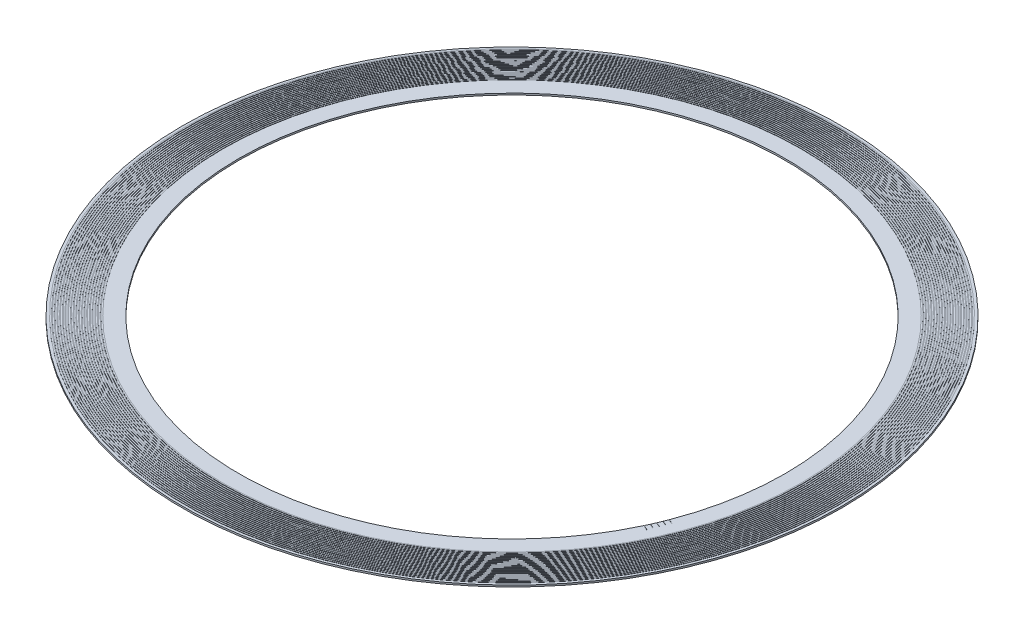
ISO-10303-21;
HEADER;
FILE_DESCRIPTION(('STEP AP214'),'2;1');
FILE_NAME('part.step','',(''),(''),'','','');
FILE_SCHEMA(('AUTOMOTIVE_DESIGN { 1 0 10303 214 1 1 1 1 }'));
ENDSEC;
DATA;
#1=APPLICATION_CONTEXT('core data for automotive mechanical design processes');
#2=APPLICATION_PROTOCOL_DEFINITION('international standard','automotive_design',2000,#1);
#3=PRODUCT_CONTEXT('',#1,'mechanical');
#4=PRODUCT('Part','Part','',(#3));
#5=PRODUCT_RELATED_PRODUCT_CATEGORY('part','',(#4));
#6=PRODUCT_DEFINITION_FORMATION('','',#4);
#7=PRODUCT_DEFINITION_CONTEXT('part definition',#1,'design');
#8=PRODUCT_DEFINITION('design','',#6,#7);
#9=PRODUCT_DEFINITION_SHAPE('','',#8);
#10=(LENGTH_UNIT() NAMED_UNIT(*) SI_UNIT(.MILLI.,.METRE.));
#11=(NAMED_UNIT(*) PLANE_ANGLE_UNIT() SI_UNIT($,.RADIAN.));
#12=(NAMED_UNIT(*) SI_UNIT($,.STERADIAN.) SOLID_ANGLE_UNIT());
#13=UNCERTAINTY_MEASURE_WITH_UNIT(LENGTH_MEASURE(1.E-05),#10,'distance_accuracy_value','');
#14=(GEOMETRIC_REPRESENTATION_CONTEXT(3) GLOBAL_UNCERTAINTY_ASSIGNED_CONTEXT((#13)) GLOBAL_UNIT_ASSIGNED_CONTEXT((#10,
#11,#12)) REPRESENTATION_CONTEXT('',''));
#15=CARTESIAN_POINT('',(0.,0.,0.));
#16=DIRECTION('',(0.,0.,1.));
#17=DIRECTION('',(1.,0.,0.));
#18=AXIS2_PLACEMENT_3D('',#15,#16,#17);
#19=CARTESIAN_POINT('',(0.,1.29999999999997,0.));
#20=DIRECTION('',(0.,-1.,0.));
#21=DIRECTION('',(1.,0.,0.));
#22=AXIS2_PLACEMENT_3D('',#19,#20,#21);
#23=PLANE('',#22);
#24=CARTESIAN_POINT('',(0.,1.29999999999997,0.));
#25=DIRECTION('',(0.,-1.,0.));
#26=DIRECTION('',(1.,0.,0.));
#27=AXIS2_PLACEMENT_3D('',#24,#25,#26);
#28=CIRCLE('',#27,242.000000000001);
#29=CARTESIAN_POINT('',(242.000000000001,1.29999999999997,0.));
#30=VERTEX_POINT('',#29);
#31=EDGE_CURVE('E421',#30,#30,#28,.F.);
#32=ORIENTED_EDGE('',*,*,#31,.T.);
#33=EDGE_LOOP('',(#32));
#34=FACE_BOUND('',#33,.T.);
#35=CARTESIAN_POINT('',(0.,1.29999999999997,0.));
#36=DIRECTION('',(0.,-1.,0.));
#37=DIRECTION('',(1.,0.,0.));
#38=AXIS2_PLACEMENT_3D('',#35,#36,#37);
#39=CIRCLE('',#38,241.500000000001);
#40=CARTESIAN_POINT('',(241.500000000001,1.29999999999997,0.));
#41=VERTEX_POINT('',#40);
#42=EDGE_CURVE('E19',#41,#41,#39,.F.);
#43=ORIENTED_EDGE('',*,*,#42,.F.);
#44=EDGE_LOOP('',(#43));
#45=FACE_BOUND('',#44,.T.);
#46=ADVANCED_FACE('F16',(#34,#45),#23,.F.);
#47=CARTESIAN_POINT('',(0.,1.51000000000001,0.));
#48=DIRECTION('',(0.,-1.,0.));
#49=DIRECTION('',(1.,0.,0.));
#50=AXIS2_PLACEMENT_3D('',#47,#48,#49);
#51=CYLINDRICAL_SURFACE('',#50,241.500000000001);
#52=ORIENTED_EDGE('',*,*,#42,.T.);
#53=EDGE_LOOP('',(#52));
#54=FACE_BOUND('',#53,.T.);
#55=CARTESIAN_POINT('',(0.,1.50000000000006,0.));
#56=DIRECTION('',(0.,-1.,0.));
#57=DIRECTION('',(1.,0.,0.));
#58=AXIS2_PLACEMENT_3D('',#55,#56,#57);
#59=CIRCLE('',#58,241.500000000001);
#60=CARTESIAN_POINT('',(241.500000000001,1.50000000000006,0.));
#61=VERTEX_POINT('',#60);
#62=EDGE_CURVE('E419',#61,#61,#59,.T.);
#63=ORIENTED_EDGE('',*,*,#62,.T.);
#64=EDGE_LOOP('',(#63));
#65=FACE_BOUND('',#64,.T.);
#66=ADVANCED_FACE('F428',(#54,#65),#51,.T.);
#67=CARTESIAN_POINT('',(0.,1.51000000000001,0.));
#68=DIRECTION('',(0.,-1.,0.));
#69=DIRECTION('',(1.,0.,0.));
#70=AXIS2_PLACEMENT_3D('',#67,#68,#69);
#71=CYLINDRICAL_SURFACE('',#70,242.000000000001);
#72=ORIENTED_EDGE('',*,*,#31,.F.);
#73=EDGE_LOOP('',(#72));
#74=FACE_BOUND('',#73,.T.);
#75=CARTESIAN_POINT('',(0.,1.50000000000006,0.));
#76=DIRECTION('',(0.,-1.,0.));
#77=DIRECTION('',(1.,0.,0.));
#78=AXIS2_PLACEMENT_3D('',#75,#76,#77);
#79=CIRCLE('',#78,242.000000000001);
#80=CARTESIAN_POINT('',(242.000000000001,1.50000000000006,0.));
#81=VERTEX_POINT('',#80);
#82=EDGE_CURVE('E416',#81,#81,#79,.F.);
#83=ORIENTED_EDGE('',*,*,#82,.T.);
#84=EDGE_LOOP('',(#83));
#85=FACE_BOUND('',#84,.T.);
#86=ADVANCED_FACE('F436',(#74,#85),#71,.F.);
#87=CARTESIAN_POINT('',(0.,1.50000000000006,0.));
#88=DIRECTION('',(0.,-1.,0.));
#89=DIRECTION('',(1.,0.,0.));
#90=AXIS2_PLACEMENT_3D('',#87,#88,#89);
#91=PLANE('',#90);
#92=ORIENTED_EDGE('',*,*,#62,.F.);
#93=EDGE_LOOP('',(#92));
#94=FACE_BOUND('',#93,.T.);
#95=CARTESIAN_POINT('',(0.,1.50000000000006,0.));
#96=DIRECTION('',(0.,-1.,0.));
#97=DIRECTION('',(1.,0.,0.));
#98=AXIS2_PLACEMENT_3D('',#95,#96,#97);
#99=CIRCLE('',#98,240.500000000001);
#100=CARTESIAN_POINT('',(240.500000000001,1.50000000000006,0.));
#101=VERTEX_POINT('',#100);
#102=EDGE_CURVE('E413',#101,#101,#99,.T.);
#103=ORIENTED_EDGE('',*,*,#102,.T.);
#104=EDGE_LOOP('',(#103));
#105=FACE_BOUND('',#104,.T.);
#106=ADVANCED_FACE('F831',(#94,#105),#91,.F.);
#107=CARTESIAN_POINT('',(0.,1.50000000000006,0.));
#108=DIRECTION('',(0.,-1.,0.));
#109=DIRECTION('',(1.,0.,0.));
#110=AXIS2_PLACEMENT_3D('',#107,#108,#109);
#111=PLANE('',#110);
#112=CARTESIAN_POINT('',(0.,1.50000000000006,0.));
#113=DIRECTION('',(0.,-1.,0.));
#114=DIRECTION('',(1.,0.,0.));
#115=AXIS2_PLACEMENT_3D('',#112,#113,#114);
#116=CIRCLE('',#115,243.000000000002);
#117=CARTESIAN_POINT('',(243.000000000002,1.50000000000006,0.));
#118=VERTEX_POINT('',#117);
#119=EDGE_CURVE('E410',#118,#118,#116,.T.);
#120=ORIENTED_EDGE('',*,*,#119,.F.);
#121=EDGE_LOOP('',(#120));
#122=FACE_BOUND('',#121,.T.);
#123=ORIENTED_EDGE('',*,*,#82,.F.);
#124=EDGE_LOOP('',(#123));
#125=FACE_BOUND('',#124,.T.);
#126=ADVANCED_FACE('F827',(#122,#125),#111,.F.);
#127=CARTESIAN_POINT('',(0.,1.51000000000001,0.));
#128=DIRECTION('',(0.,-1.,0.));
#129=DIRECTION('',(1.,0.,0.));
#130=AXIS2_PLACEMENT_3D('',#127,#128,#129);
#131=CYLINDRICAL_SURFACE('',#130,240.500000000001);
#132=ORIENTED_EDGE('',*,*,#102,.F.);
#133=EDGE_LOOP('',(#132));
#134=FACE_BOUND('',#133,.T.);
#135=CARTESIAN_POINT('',(0.,1.29999999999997,0.));
#136=DIRECTION('',(0.,-1.,0.));
#137=DIRECTION('',(1.,0.,0.));
#138=AXIS2_PLACEMENT_3D('',#135,#136,#137);
#139=CIRCLE('',#138,240.500000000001);
#140=CARTESIAN_POINT('',(240.500000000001,1.29999999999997,0.));
#141=VERTEX_POINT('',#140);
#142=EDGE_CURVE('E407',#141,#141,#139,.T.);
#143=ORIENTED_EDGE('',*,*,#142,.T.);
#144=EDGE_LOOP('',(#143));
#145=FACE_BOUND('',#144,.T.);
#146=ADVANCED_FACE('F823',(#134,#145),#131,.F.);
#147=CARTESIAN_POINT('',(0.,1.51000000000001,0.));
#148=DIRECTION('',(0.,-1.,0.));
#149=DIRECTION('',(1.,0.,0.));
#150=AXIS2_PLACEMENT_3D('',#147,#148,#149);
#151=CYLINDRICAL_SURFACE('',#150,243.000000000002);
#152=ORIENTED_EDGE('',*,*,#119,.T.);
#153=EDGE_LOOP('',(#152));
#154=FACE_BOUND('',#153,.T.);
#155=CARTESIAN_POINT('',(0.,1.29999999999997,0.));
#156=DIRECTION('',(0.,-1.,0.));
#157=DIRECTION('',(1.,0.,0.));
#158=AXIS2_PLACEMENT_3D('',#155,#156,#157);
#159=CIRCLE('',#158,243.000000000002);
#160=CARTESIAN_POINT('',(243.000000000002,1.29999999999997,0.));
#161=VERTEX_POINT('',#160);
#162=EDGE_CURVE('E404',#161,#161,#159,.F.);
#163=ORIENTED_EDGE('',*,*,#162,.T.);
#164=EDGE_LOOP('',(#163));
#165=FACE_BOUND('',#164,.T.);
#166=ADVANCED_FACE('F819',(#154,#165),#151,.T.);
#167=CARTESIAN_POINT('',(0.,1.29999999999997,0.));
#168=DIRECTION('',(0.,-1.,0.));
#169=DIRECTION('',(1.,0.,0.));
#170=AXIS2_PLACEMENT_3D('',#167,#168,#169);
#171=PLANE('',#170);
#172=ORIENTED_EDGE('',*,*,#142,.F.);
#173=EDGE_LOOP('',(#172));
#174=FACE_BOUND('',#173,.T.);
#175=CARTESIAN_POINT('',(0.,1.29999999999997,0.));
#176=DIRECTION('',(0.,-1.,0.));
#177=DIRECTION('',(1.,0.,0.));
#178=AXIS2_PLACEMENT_3D('',#175,#176,#177);
#179=CIRCLE('',#178,240.000000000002);
#180=CARTESIAN_POINT('',(240.000000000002,1.29999999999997,0.));
#181=VERTEX_POINT('',#180);
#182=EDGE_CURVE('E401',#181,#181,#179,.F.);
#183=ORIENTED_EDGE('',*,*,#182,.F.);
#184=EDGE_LOOP('',(#183));
#185=FACE_BOUND('',#184,.T.);
#186=ADVANCED_FACE('F815',(#174,#185),#171,.F.);
#187=CARTESIAN_POINT('',(0.,1.29999999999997,0.));
#188=DIRECTION('',(0.,-1.,0.));
#189=DIRECTION('',(1.,0.,0.));
#190=AXIS2_PLACEMENT_3D('',#187,#188,#189);
#191=PLANE('',#190);
#192=CARTESIAN_POINT('',(0.,1.29999999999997,0.));
#193=DIRECTION('',(0.,-1.,0.));
#194=DIRECTION('',(1.,0.,0.));
#195=AXIS2_PLACEMENT_3D('',#192,#193,#194);
#196=CIRCLE('',#195,243.500000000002);
#197=CARTESIAN_POINT('',(243.500000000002,1.29999999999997,0.));
#198=VERTEX_POINT('',#197);
#199=EDGE_CURVE('E398',#198,#198,#196,.F.);
#200=ORIENTED_EDGE('',*,*,#199,.T.);
#201=EDGE_LOOP('',(#200));
#202=FACE_BOUND('',#201,.T.);
#203=ORIENTED_EDGE('',*,*,#162,.F.);
#204=EDGE_LOOP('',(#203));
#205=FACE_BOUND('',#204,.T.);
#206=ADVANCED_FACE('F811',(#202,#205),#191,.F.);
#207=CARTESIAN_POINT('',(0.,1.51000000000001,0.));
#208=DIRECTION('',(0.,-1.,0.));
#209=DIRECTION('',(1.,0.,0.));
#210=AXIS2_PLACEMENT_3D('',#207,#208,#209);
#211=CYLINDRICAL_SURFACE('',#210,240.000000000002);
#212=ORIENTED_EDGE('',*,*,#182,.T.);
#213=EDGE_LOOP('',(#212));
#214=FACE_BOUND('',#213,.T.);
#215=CARTESIAN_POINT('',(0.,1.50000000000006,0.));
#216=DIRECTION('',(0.,-1.,0.));
#217=DIRECTION('',(1.,0.,0.));
#218=AXIS2_PLACEMENT_3D('',#215,#216,#217);
#219=CIRCLE('',#218,240.000000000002);
#220=CARTESIAN_POINT('',(240.000000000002,1.50000000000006,0.));
#221=VERTEX_POINT('',#220);
#222=EDGE_CURVE('E395',#221,#221,#219,.T.);
#223=ORIENTED_EDGE('',*,*,#222,.T.);
#224=EDGE_LOOP('',(#223));
#225=FACE_BOUND('',#224,.T.);
#226=ADVANCED_FACE('F807',(#214,#225),#211,.T.);
#227=CARTESIAN_POINT('',(0.,1.51000000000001,0.));
#228=DIRECTION('',(0.,-1.,0.));
#229=DIRECTION('',(1.,0.,0.));
#230=AXIS2_PLACEMENT_3D('',#227,#228,#229);
#231=CYLINDRICAL_SURFACE('',#230,243.500000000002);
#232=ORIENTED_EDGE('',*,*,#199,.F.);
#233=EDGE_LOOP('',(#232));
#234=FACE_BOUND('',#233,.T.);
#235=CARTESIAN_POINT('',(0.,1.50000000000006,0.));
#236=DIRECTION('',(0.,-1.,0.));
#237=DIRECTION('',(1.,0.,0.));
#238=AXIS2_PLACEMENT_3D('',#235,#236,#237);
#239=CIRCLE('',#238,243.500000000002);
#240=CARTESIAN_POINT('',(243.500000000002,1.50000000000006,0.));
#241=VERTEX_POINT('',#240);
#242=EDGE_CURVE('E392',#241,#241,#239,.F.);
#243=ORIENTED_EDGE('',*,*,#242,.T.);
#244=EDGE_LOOP('',(#243));
#245=FACE_BOUND('',#244,.T.);
#246=ADVANCED_FACE('F803',(#234,#245),#231,.F.);
#247=CARTESIAN_POINT('',(0.,1.50000000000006,0.));
#248=DIRECTION('',(0.,-1.,0.));
#249=DIRECTION('',(1.,0.,0.));
#250=AXIS2_PLACEMENT_3D('',#247,#248,#249);
#251=PLANE('',#250);
#252=ORIENTED_EDGE('',*,*,#222,.F.);
#253=EDGE_LOOP('',(#252));
#254=FACE_BOUND('',#253,.T.);
#255=CARTESIAN_POINT('',(0.,1.50000000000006,0.));
#256=DIRECTION('',(0.,-1.,0.));
#257=DIRECTION('',(1.,0.,0.));
#258=AXIS2_PLACEMENT_3D('',#255,#256,#257);
#259=CIRCLE('',#258,239.000000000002);
#260=CARTESIAN_POINT('',(239.000000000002,1.50000000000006,0.));
#261=VERTEX_POINT('',#260);
#262=EDGE_CURVE('E389',#261,#261,#259,.T.);
#263=ORIENTED_EDGE('',*,*,#262,.T.);
#264=EDGE_LOOP('',(#263));
#265=FACE_BOUND('',#264,.T.);
#266=ADVANCED_FACE('F799',(#254,#265),#251,.F.);
#267=CARTESIAN_POINT('',(0.,1.50000000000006,0.));
#268=DIRECTION('',(0.,-1.,0.));
#269=DIRECTION('',(1.,0.,0.));
#270=AXIS2_PLACEMENT_3D('',#267,#268,#269);
#271=PLANE('',#270);
#272=CARTESIAN_POINT('',(0.,1.50000000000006,0.));
#273=DIRECTION('',(0.,-1.,0.));
#274=DIRECTION('',(1.,0.,0.));
#275=AXIS2_PLACEMENT_3D('',#272,#273,#274);
#276=CIRCLE('',#275,244.500000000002);
#277=CARTESIAN_POINT('',(244.500000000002,1.50000000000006,0.));
#278=VERTEX_POINT('',#277);
#279=EDGE_CURVE('E386',#278,#278,#276,.T.);
#280=ORIENTED_EDGE('',*,*,#279,.F.);
#281=EDGE_LOOP('',(#280));
#282=FACE_BOUND('',#281,.T.);
#283=ORIENTED_EDGE('',*,*,#242,.F.);
#284=EDGE_LOOP('',(#283));
#285=FACE_BOUND('',#284,.T.);
#286=ADVANCED_FACE('F795',(#282,#285),#271,.F.);
#287=CARTESIAN_POINT('',(0.,1.51000000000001,0.));
#288=DIRECTION('',(0.,-1.,0.));
#289=DIRECTION('',(1.,0.,0.));
#290=AXIS2_PLACEMENT_3D('',#287,#288,#289);
#291=CYLINDRICAL_SURFACE('',#290,239.000000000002);
#292=ORIENTED_EDGE('',*,*,#262,.F.);
#293=EDGE_LOOP('',(#292));
#294=FACE_BOUND('',#293,.T.);
#295=CARTESIAN_POINT('',(0.,1.29999999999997,0.));
#296=DIRECTION('',(0.,-1.,0.));
#297=DIRECTION('',(1.,0.,0.));
#298=AXIS2_PLACEMENT_3D('',#295,#296,#297);
#299=CIRCLE('',#298,239.000000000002);
#300=CARTESIAN_POINT('',(239.000000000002,1.29999999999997,0.));
#301=VERTEX_POINT('',#300);
#302=EDGE_CURVE('E383',#301,#301,#299,.T.);
#303=ORIENTED_EDGE('',*,*,#302,.T.);
#304=EDGE_LOOP('',(#303));
#305=FACE_BOUND('',#304,.T.);
#306=ADVANCED_FACE('F791',(#294,#305),#291,.F.);
#307=CARTESIAN_POINT('',(0.,1.51000000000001,0.));
#308=DIRECTION('',(0.,-1.,0.));
#309=DIRECTION('',(1.,0.,0.));
#310=AXIS2_PLACEMENT_3D('',#307,#308,#309);
#311=CYLINDRICAL_SURFACE('',#310,244.500000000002);
#312=ORIENTED_EDGE('',*,*,#279,.T.);
#313=EDGE_LOOP('',(#312));
#314=FACE_BOUND('',#313,.T.);
#315=CARTESIAN_POINT('',(0.,1.29999999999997,0.));
#316=DIRECTION('',(0.,-1.,0.));
#317=DIRECTION('',(1.,0.,0.));
#318=AXIS2_PLACEMENT_3D('',#315,#316,#317);
#319=CIRCLE('',#318,244.500000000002);
#320=CARTESIAN_POINT('',(244.500000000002,1.29999999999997,0.));
#321=VERTEX_POINT('',#320);
#322=EDGE_CURVE('E380',#321,#321,#319,.F.);
#323=ORIENTED_EDGE('',*,*,#322,.T.);
#324=EDGE_LOOP('',(#323));
#325=FACE_BOUND('',#324,.T.);
#326=ADVANCED_FACE('F787',(#314,#325),#311,.T.);
#327=CARTESIAN_POINT('',(0.,1.29999999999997,0.));
#328=DIRECTION('',(0.,-1.,0.));
#329=DIRECTION('',(1.,0.,0.));
#330=AXIS2_PLACEMENT_3D('',#327,#328,#329);
#331=PLANE('',#330);
#332=ORIENTED_EDGE('',*,*,#302,.F.);
#333=EDGE_LOOP('',(#332));
#334=FACE_BOUND('',#333,.T.);
#335=CARTESIAN_POINT('',(0.,1.29999999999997,0.));
#336=DIRECTION('',(0.,-1.,0.));
#337=DIRECTION('',(1.,0.,0.));
#338=AXIS2_PLACEMENT_3D('',#335,#336,#337);
#339=CIRCLE('',#338,238.500000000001);
#340=CARTESIAN_POINT('',(238.500000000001,1.29999999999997,0.));
#341=VERTEX_POINT('',#340);
#342=EDGE_CURVE('E377',#341,#341,#339,.F.);
#343=ORIENTED_EDGE('',*,*,#342,.F.);
#344=EDGE_LOOP('',(#343));
#345=FACE_BOUND('',#344,.T.);
#346=ADVANCED_FACE('F783',(#334,#345),#331,.F.);
#347=CARTESIAN_POINT('',(0.,1.29999999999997,0.));
#348=DIRECTION('',(0.,-1.,0.));
#349=DIRECTION('',(1.,0.,0.));
#350=AXIS2_PLACEMENT_3D('',#347,#348,#349);
#351=PLANE('',#350);
#352=CARTESIAN_POINT('',(0.,1.29999999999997,0.));
#353=DIRECTION('',(0.,-1.,0.));
#354=DIRECTION('',(1.,0.,0.));
#355=AXIS2_PLACEMENT_3D('',#352,#353,#354);
#356=CIRCLE('',#355,245.000000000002);
#357=CARTESIAN_POINT('',(245.000000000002,1.29999999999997,0.));
#358=VERTEX_POINT('',#357);
#359=EDGE_CURVE('E374',#358,#358,#356,.F.);
#360=ORIENTED_EDGE('',*,*,#359,.T.);
#361=EDGE_LOOP('',(#360));
#362=FACE_BOUND('',#361,.T.);
#363=ORIENTED_EDGE('',*,*,#322,.F.);
#364=EDGE_LOOP('',(#363));
#365=FACE_BOUND('',#364,.T.);
#366=ADVANCED_FACE('F779',(#362,#365),#351,.F.);
#367=CARTESIAN_POINT('',(0.,1.51000000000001,0.));
#368=DIRECTION('',(0.,-1.,0.));
#369=DIRECTION('',(1.,0.,0.));
#370=AXIS2_PLACEMENT_3D('',#367,#368,#369);
#371=CYLINDRICAL_SURFACE('',#370,238.500000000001);
#372=ORIENTED_EDGE('',*,*,#342,.T.);
#373=EDGE_LOOP('',(#372));
#374=FACE_BOUND('',#373,.T.);
#375=CARTESIAN_POINT('',(0.,1.50000000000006,0.));
#376=DIRECTION('',(0.,-1.,0.));
#377=DIRECTION('',(1.,0.,0.));
#378=AXIS2_PLACEMENT_3D('',#375,#376,#377);
#379=CIRCLE('',#378,238.500000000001);
#380=CARTESIAN_POINT('',(238.500000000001,1.50000000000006,0.));
#381=VERTEX_POINT('',#380);
#382=EDGE_CURVE('E371',#381,#381,#379,.T.);
#383=ORIENTED_EDGE('',*,*,#382,.T.);
#384=EDGE_LOOP('',(#383));
#385=FACE_BOUND('',#384,.T.);
#386=ADVANCED_FACE('F775',(#374,#385),#371,.T.);
#387=CARTESIAN_POINT('',(0.,1.51000000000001,0.));
#388=DIRECTION('',(0.,-1.,0.));
#389=DIRECTION('',(1.,0.,0.));
#390=AXIS2_PLACEMENT_3D('',#387,#388,#389);
#391=CYLINDRICAL_SURFACE('',#390,245.000000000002);
#392=ORIENTED_EDGE('',*,*,#359,.F.);
#393=EDGE_LOOP('',(#392));
#394=FACE_BOUND('',#393,.T.);
#395=CARTESIAN_POINT('',(0.,1.50000000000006,0.));
#396=DIRECTION('',(0.,-1.,0.));
#397=DIRECTION('',(1.,0.,0.));
#398=AXIS2_PLACEMENT_3D('',#395,#396,#397);
#399=CIRCLE('',#398,245.000000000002);
#400=CARTESIAN_POINT('',(245.000000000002,1.50000000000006,0.));
#401=VERTEX_POINT('',#400);
#402=EDGE_CURVE('E368',#401,#401,#399,.F.);
#403=ORIENTED_EDGE('',*,*,#402,.T.);
#404=EDGE_LOOP('',(#403));
#405=FACE_BOUND('',#404,.T.);
#406=ADVANCED_FACE('F771',(#394,#405),#391,.F.);
#407=CARTESIAN_POINT('',(0.,1.50000000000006,0.));
#408=DIRECTION('',(0.,-1.,0.));
#409=DIRECTION('',(1.,0.,0.));
#410=AXIS2_PLACEMENT_3D('',#407,#408,#409);
#411=PLANE('',#410);
#412=ORIENTED_EDGE('',*,*,#382,.F.);
#413=EDGE_LOOP('',(#412));
#414=FACE_BOUND('',#413,.T.);
#415=CARTESIAN_POINT('',(0.,1.50000000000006,0.));
#416=DIRECTION('',(0.,-1.,0.));
#417=DIRECTION('',(1.,0.,0.));
#418=AXIS2_PLACEMENT_3D('',#415,#416,#417);
#419=CIRCLE('',#418,237.500000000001);
#420=CARTESIAN_POINT('',(237.500000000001,1.50000000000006,0.));
#421=VERTEX_POINT('',#420);
#422=EDGE_CURVE('E365',#421,#421,#419,.T.);
#423=ORIENTED_EDGE('',*,*,#422,.T.);
#424=EDGE_LOOP('',(#423));
#425=FACE_BOUND('',#424,.T.);
#426=ADVANCED_FACE('F767',(#414,#425),#411,.F.);
#427=CARTESIAN_POINT('',(0.,1.50000000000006,0.));
#428=DIRECTION('',(0.,-1.,0.));
#429=DIRECTION('',(1.,0.,0.));
#430=AXIS2_PLACEMENT_3D('',#427,#428,#429);
#431=PLANE('',#430);
#432=CARTESIAN_POINT('',(0.,1.50000000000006,0.));
#433=DIRECTION('',(0.,-1.,0.));
#434=DIRECTION('',(1.,0.,0.));
#435=AXIS2_PLACEMENT_3D('',#432,#433,#434);
#436=CIRCLE('',#435,246.000000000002);
#437=CARTESIAN_POINT('',(246.000000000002,1.50000000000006,0.));
#438=VERTEX_POINT('',#437);
#439=EDGE_CURVE('E362',#438,#438,#436,.T.);
#440=ORIENTED_EDGE('',*,*,#439,.F.);
#441=EDGE_LOOP('',(#440));
#442=FACE_BOUND('',#441,.T.);
#443=ORIENTED_EDGE('',*,*,#402,.F.);
#444=EDGE_LOOP('',(#443));
#445=FACE_BOUND('',#444,.T.);
#446=ADVANCED_FACE('F763',(#442,#445),#431,.F.);
#447=CARTESIAN_POINT('',(0.,1.51000000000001,0.));
#448=DIRECTION('',(0.,-1.,0.));
#449=DIRECTION('',(1.,0.,0.));
#450=AXIS2_PLACEMENT_3D('',#447,#448,#449);
#451=CYLINDRICAL_SURFACE('',#450,237.500000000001);
#452=ORIENTED_EDGE('',*,*,#422,.F.);
#453=EDGE_LOOP('',(#452));
#454=FACE_BOUND('',#453,.T.);
#455=CARTESIAN_POINT('',(0.,1.29999999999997,0.));
#456=DIRECTION('',(0.,-1.,0.));
#457=DIRECTION('',(1.,0.,0.));
#458=AXIS2_PLACEMENT_3D('',#455,#456,#457);
#459=CIRCLE('',#458,237.500000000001);
#460=CARTESIAN_POINT('',(237.500000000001,1.29999999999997,0.));
#461=VERTEX_POINT('',#460);
#462=EDGE_CURVE('E359',#461,#461,#459,.T.);
#463=ORIENTED_EDGE('',*,*,#462,.T.);
#464=EDGE_LOOP('',(#463));
#465=FACE_BOUND('',#464,.T.);
#466=ADVANCED_FACE('F759',(#454,#465),#451,.F.);
#467=CARTESIAN_POINT('',(0.,1.51000000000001,0.));
#468=DIRECTION('',(0.,-1.,0.));
#469=DIRECTION('',(1.,0.,0.));
#470=AXIS2_PLACEMENT_3D('',#467,#468,#469);
#471=CYLINDRICAL_SURFACE('',#470,246.000000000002);
#472=ORIENTED_EDGE('',*,*,#439,.T.);
#473=EDGE_LOOP('',(#472));
#474=FACE_BOUND('',#473,.T.);
#475=CARTESIAN_POINT('',(0.,1.29999999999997,0.));
#476=DIRECTION('',(0.,-1.,0.));
#477=DIRECTION('',(1.,0.,0.));
#478=AXIS2_PLACEMENT_3D('',#475,#476,#477);
#479=CIRCLE('',#478,246.000000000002);
#480=CARTESIAN_POINT('',(246.000000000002,1.29999999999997,0.));
#481=VERTEX_POINT('',#480);
#482=EDGE_CURVE('E356',#481,#481,#479,.F.);
#483=ORIENTED_EDGE('',*,*,#482,.T.);
#484=EDGE_LOOP('',(#483));
#485=FACE_BOUND('',#484,.T.);
#486=ADVANCED_FACE('F755',(#474,#485),#471,.T.);
#487=CARTESIAN_POINT('',(0.,1.29999999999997,0.));
#488=DIRECTION('',(0.,-1.,0.));
#489=DIRECTION('',(1.,0.,0.));
#490=AXIS2_PLACEMENT_3D('',#487,#488,#489);
#491=PLANE('',#490);
#492=ORIENTED_EDGE('',*,*,#462,.F.);
#493=EDGE_LOOP('',(#492));
#494=FACE_BOUND('',#493,.T.);
#495=CARTESIAN_POINT('',(0.,1.29999999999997,0.));
#496=DIRECTION('',(0.,-1.,0.));
#497=DIRECTION('',(1.,0.,0.));
#498=AXIS2_PLACEMENT_3D('',#495,#496,#497);
#499=CIRCLE('',#498,237.000000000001);
#500=CARTESIAN_POINT('',(237.000000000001,1.29999999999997,0.));
#501=VERTEX_POINT('',#500);
#502=EDGE_CURVE('E353',#501,#501,#499,.F.);
#503=ORIENTED_EDGE('',*,*,#502,.F.);
#504=EDGE_LOOP('',(#503));
#505=FACE_BOUND('',#504,.T.);
#506=ADVANCED_FACE('F751',(#494,#505),#491,.F.);
#507=CARTESIAN_POINT('',(0.,1.29999999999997,0.));
#508=DIRECTION('',(0.,-1.,0.));
#509=DIRECTION('',(1.,0.,0.));
#510=AXIS2_PLACEMENT_3D('',#507,#508,#509);
#511=PLANE('',#510);
#512=CARTESIAN_POINT('',(0.,1.29999999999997,0.));
#513=DIRECTION('',(0.,-1.,0.));
#514=DIRECTION('',(1.,0.,0.));
#515=AXIS2_PLACEMENT_3D('',#512,#513,#514);
#516=CIRCLE('',#515,246.500000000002);
#517=CARTESIAN_POINT('',(246.500000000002,1.29999999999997,0.));
#518=VERTEX_POINT('',#517);
#519=EDGE_CURVE('E350',#518,#518,#516,.F.);
#520=ORIENTED_EDGE('',*,*,#519,.T.);
#521=EDGE_LOOP('',(#520));
#522=FACE_BOUND('',#521,.T.);
#523=ORIENTED_EDGE('',*,*,#482,.F.);
#524=EDGE_LOOP('',(#523));
#525=FACE_BOUND('',#524,.T.);
#526=ADVANCED_FACE('F747',(#522,#525),#511,.F.);
#527=CARTESIAN_POINT('',(0.,1.51000000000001,0.));
#528=DIRECTION('',(0.,-1.,0.));
#529=DIRECTION('',(1.,0.,0.));
#530=AXIS2_PLACEMENT_3D('',#527,#528,#529);
#531=CYLINDRICAL_SURFACE('',#530,237.000000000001);
#532=ORIENTED_EDGE('',*,*,#502,.T.);
#533=EDGE_LOOP('',(#532));
#534=FACE_BOUND('',#533,.T.);
#535=CARTESIAN_POINT('',(0.,1.50000000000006,0.));
#536=DIRECTION('',(0.,-1.,0.));
#537=DIRECTION('',(1.,0.,0.));
#538=AXIS2_PLACEMENT_3D('',#535,#536,#537);
#539=CIRCLE('',#538,237.000000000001);
#540=CARTESIAN_POINT('',(237.000000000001,1.50000000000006,0.));
#541=VERTEX_POINT('',#540);
#542=EDGE_CURVE('E347',#541,#541,#539,.T.);
#543=ORIENTED_EDGE('',*,*,#542,.T.);
#544=EDGE_LOOP('',(#543));
#545=FACE_BOUND('',#544,.T.);
#546=ADVANCED_FACE('F743',(#534,#545),#531,.T.);
#547=CARTESIAN_POINT('',(0.,1.51000000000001,0.));
#548=DIRECTION('',(0.,-1.,0.));
#549=DIRECTION('',(1.,0.,0.));
#550=AXIS2_PLACEMENT_3D('',#547,#548,#549);
#551=CYLINDRICAL_SURFACE('',#550,246.500000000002);
#552=ORIENTED_EDGE('',*,*,#519,.F.);
#553=EDGE_LOOP('',(#552));
#554=FACE_BOUND('',#553,.T.);
#555=CARTESIAN_POINT('',(0.,1.50000000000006,0.));
#556=DIRECTION('',(0.,-1.,0.));
#557=DIRECTION('',(1.,0.,0.));
#558=AXIS2_PLACEMENT_3D('',#555,#556,#557);
#559=CIRCLE('',#558,246.500000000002);
#560=CARTESIAN_POINT('',(246.500000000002,1.50000000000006,0.));
#561=VERTEX_POINT('',#560);
#562=EDGE_CURVE('E344',#561,#561,#559,.F.);
#563=ORIENTED_EDGE('',*,*,#562,.T.);
#564=EDGE_LOOP('',(#563));
#565=FACE_BOUND('',#564,.T.);
#566=ADVANCED_FACE('F739',(#554,#565),#551,.F.);
#567=CARTESIAN_POINT('',(0.,1.50000000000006,0.));
#568=DIRECTION('',(0.,-1.,0.));
#569=DIRECTION('',(1.,0.,0.));
#570=AXIS2_PLACEMENT_3D('',#567,#568,#569);
#571=PLANE('',#570);
#572=ORIENTED_EDGE('',*,*,#542,.F.);
#573=EDGE_LOOP('',(#572));
#574=FACE_BOUND('',#573,.T.);
#575=CARTESIAN_POINT('',(0.,1.50000000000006,0.));
#576=DIRECTION('',(0.,-1.,0.));
#577=DIRECTION('',(1.,0.,0.));
#578=AXIS2_PLACEMENT_3D('',#575,#576,#577);
#579=CIRCLE('',#578,236.000000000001);
#580=CARTESIAN_POINT('',(236.000000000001,1.50000000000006,0.));
#581=VERTEX_POINT('',#580);
#582=EDGE_CURVE('E341',#581,#581,#579,.T.);
#583=ORIENTED_EDGE('',*,*,#582,.T.);
#584=EDGE_LOOP('',(#583));
#585=FACE_BOUND('',#584,.T.);
#586=ADVANCED_FACE('F735',(#574,#585),#571,.F.);
#587=CARTESIAN_POINT('',(0.,1.50000000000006,0.));
#588=DIRECTION('',(0.,-1.,0.));
#589=DIRECTION('',(1.,0.,0.));
#590=AXIS2_PLACEMENT_3D('',#587,#588,#589);
#591=PLANE('',#590);
#592=CARTESIAN_POINT('',(0.,1.50000000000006,0.));
#593=DIRECTION('',(0.,-1.,0.));
#594=DIRECTION('',(1.,0.,0.));
#595=AXIS2_PLACEMENT_3D('',#592,#593,#594);
#596=CIRCLE('',#595,247.500000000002);
#597=CARTESIAN_POINT('',(247.500000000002,1.50000000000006,0.));
#598=VERTEX_POINT('',#597);
#599=EDGE_CURVE('E338',#598,#598,#596,.T.);
#600=ORIENTED_EDGE('',*,*,#599,.F.);
#601=EDGE_LOOP('',(#600));
#602=FACE_BOUND('',#601,.T.);
#603=ORIENTED_EDGE('',*,*,#562,.F.);
#604=EDGE_LOOP('',(#603));
#605=FACE_BOUND('',#604,.T.);
#606=ADVANCED_FACE('F731',(#602,#605),#591,.F.);
#607=CARTESIAN_POINT('',(0.,1.51000000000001,0.));
#608=DIRECTION('',(0.,-1.,0.));
#609=DIRECTION('',(1.,0.,0.));
#610=AXIS2_PLACEMENT_3D('',#607,#608,#609);
#611=CYLINDRICAL_SURFACE('',#610,236.000000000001);
#612=ORIENTED_EDGE('',*,*,#582,.F.);
#613=EDGE_LOOP('',(#612));
#614=FACE_BOUND('',#613,.T.);
#615=CARTESIAN_POINT('',(0.,1.29999999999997,0.));
#616=DIRECTION('',(0.,-1.,0.));
#617=DIRECTION('',(1.,0.,0.));
#618=AXIS2_PLACEMENT_3D('',#615,#616,#617);
#619=CIRCLE('',#618,236.000000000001);
#620=CARTESIAN_POINT('',(236.000000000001,1.29999999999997,0.));
#621=VERTEX_POINT('',#620);
#622=EDGE_CURVE('E335',#621,#621,#619,.T.);
#623=ORIENTED_EDGE('',*,*,#622,.T.);
#624=EDGE_LOOP('',(#623));
#625=FACE_BOUND('',#624,.T.);
#626=ADVANCED_FACE('F727',(#614,#625),#611,.F.);
#627=CARTESIAN_POINT('',(0.,1.51000000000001,0.));
#628=DIRECTION('',(0.,-1.,0.));
#629=DIRECTION('',(1.,0.,0.));
#630=AXIS2_PLACEMENT_3D('',#627,#628,#629);
#631=CYLINDRICAL_SURFACE('',#630,247.500000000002);
#632=ORIENTED_EDGE('',*,*,#599,.T.);
#633=EDGE_LOOP('',(#632));
#634=FACE_BOUND('',#633,.T.);
#635=CARTESIAN_POINT('',(0.,1.29999999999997,0.));
#636=DIRECTION('',(0.,-1.,0.));
#637=DIRECTION('',(1.,0.,0.));
#638=AXIS2_PLACEMENT_3D('',#635,#636,#637);
#639=CIRCLE('',#638,247.500000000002);
#640=CARTESIAN_POINT('',(247.500000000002,1.29999999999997,0.));
#641=VERTEX_POINT('',#640);
#642=EDGE_CURVE('E332',#641,#641,#639,.F.);
#643=ORIENTED_EDGE('',*,*,#642,.T.);
#644=EDGE_LOOP('',(#643));
#645=FACE_BOUND('',#644,.T.);
#646=ADVANCED_FACE('F723',(#634,#645),#631,.T.);
#647=CARTESIAN_POINT('',(0.,1.29999999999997,0.));
#648=DIRECTION('',(0.,-1.,0.));
#649=DIRECTION('',(1.,0.,0.));
#650=AXIS2_PLACEMENT_3D('',#647,#648,#649);
#651=PLANE('',#650);
#652=ORIENTED_EDGE('',*,*,#622,.F.);
#653=EDGE_LOOP('',(#652));
#654=FACE_BOUND('',#653,.T.);
#655=CARTESIAN_POINT('',(0.,1.29999999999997,0.));
#656=DIRECTION('',(0.,-1.,0.));
#657=DIRECTION('',(1.,0.,0.));
#658=AXIS2_PLACEMENT_3D('',#655,#656,#657);
#659=CIRCLE('',#658,235.500000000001);
#660=CARTESIAN_POINT('',(235.500000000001,1.29999999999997,0.));
#661=VERTEX_POINT('',#660);
#662=EDGE_CURVE('E329',#661,#661,#659,.F.);
#663=ORIENTED_EDGE('',*,*,#662,.F.);
#664=EDGE_LOOP('',(#663));
#665=FACE_BOUND('',#664,.T.);
#666=ADVANCED_FACE('F719',(#654,#665),#651,.F.);
#667=CARTESIAN_POINT('',(0.,1.29999999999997,0.));
#668=DIRECTION('',(0.,-1.,0.));
#669=DIRECTION('',(1.,0.,0.));
#670=AXIS2_PLACEMENT_3D('',#667,#668,#669);
#671=PLANE('',#670);
#672=CARTESIAN_POINT('',(0.,1.29999999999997,0.));
#673=DIRECTION('',(0.,-1.,0.));
#674=DIRECTION('',(1.,0.,0.));
#675=AXIS2_PLACEMENT_3D('',#672,#673,#674);
#676=CIRCLE('',#675,248.000000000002);
#677=CARTESIAN_POINT('',(248.000000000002,1.29999999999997,0.));
#678=VERTEX_POINT('',#677);
#679=EDGE_CURVE('E326',#678,#678,#676,.F.);
#680=ORIENTED_EDGE('',*,*,#679,.T.);
#681=EDGE_LOOP('',(#680));
#682=FACE_BOUND('',#681,.T.);
#683=ORIENTED_EDGE('',*,*,#642,.F.);
#684=EDGE_LOOP('',(#683));
#685=FACE_BOUND('',#684,.T.);
#686=ADVANCED_FACE('F715',(#682,#685),#671,.F.);
#687=CARTESIAN_POINT('',(0.,1.51000000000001,0.));
#688=DIRECTION('',(0.,-1.,0.));
#689=DIRECTION('',(1.,0.,0.));
#690=AXIS2_PLACEMENT_3D('',#687,#688,#689);
#691=CYLINDRICAL_SURFACE('',#690,235.500000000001);
#692=ORIENTED_EDGE('',*,*,#662,.T.);
#693=EDGE_LOOP('',(#692));
#694=FACE_BOUND('',#693,.T.);
#695=CARTESIAN_POINT('',(0.,1.50000000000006,0.));
#696=DIRECTION('',(0.,-1.,0.));
#697=DIRECTION('',(1.,0.,0.));
#698=AXIS2_PLACEMENT_3D('',#695,#696,#697);
#699=CIRCLE('',#698,235.500000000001);
#700=CARTESIAN_POINT('',(235.500000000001,1.50000000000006,0.));
#701=VERTEX_POINT('',#700);
#702=EDGE_CURVE('E323',#701,#701,#699,.T.);
#703=ORIENTED_EDGE('',*,*,#702,.T.);
#704=EDGE_LOOP('',(#703));
#705=FACE_BOUND('',#704,.T.);
#706=ADVANCED_FACE('F711',(#694,#705),#691,.T.);
#707=CARTESIAN_POINT('',(0.,1.51000000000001,0.));
#708=DIRECTION('',(0.,-1.,0.));
#709=DIRECTION('',(1.,0.,0.));
#710=AXIS2_PLACEMENT_3D('',#707,#708,#709);
#711=CYLINDRICAL_SURFACE('',#710,248.000000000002);
#712=ORIENTED_EDGE('',*,*,#679,.F.);
#713=EDGE_LOOP('',(#712));
#714=FACE_BOUND('',#713,.T.);
#715=CARTESIAN_POINT('',(0.,1.50000000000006,0.));
#716=DIRECTION('',(0.,-1.,0.));
#717=DIRECTION('',(1.,0.,0.));
#718=AXIS2_PLACEMENT_3D('',#715,#716,#717);
#719=CIRCLE('',#718,248.000000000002);
#720=CARTESIAN_POINT('',(248.000000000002,1.50000000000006,0.));
#721=VERTEX_POINT('',#720);
#722=EDGE_CURVE('E320',#721,#721,#719,.F.);
#723=ORIENTED_EDGE('',*,*,#722,.T.);
#724=EDGE_LOOP('',(#723));
#725=FACE_BOUND('',#724,.T.);
#726=ADVANCED_FACE('F707',(#714,#725),#711,.F.);
#727=CARTESIAN_POINT('',(0.,1.50000000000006,0.));
#728=DIRECTION('',(0.,-1.,0.));
#729=DIRECTION('',(1.,0.,0.));
#730=AXIS2_PLACEMENT_3D('',#727,#728,#729);
#731=PLANE('',#730);
#732=ORIENTED_EDGE('',*,*,#702,.F.);
#733=EDGE_LOOP('',(#732));
#734=FACE_BOUND('',#733,.T.);
#735=CARTESIAN_POINT('',(0.,1.50000000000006,0.));
#736=DIRECTION('',(0.,-1.,0.));
#737=DIRECTION('',(1.,0.,0.));
#738=AXIS2_PLACEMENT_3D('',#735,#736,#737);
#739=CIRCLE('',#738,234.500000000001);
#740=CARTESIAN_POINT('',(234.500000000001,1.50000000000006,0.));
#741=VERTEX_POINT('',#740);
#742=EDGE_CURVE('E317',#741,#741,#739,.T.);
#743=ORIENTED_EDGE('',*,*,#742,.T.);
#744=EDGE_LOOP('',(#743));
#745=FACE_BOUND('',#744,.T.);
#746=ADVANCED_FACE('F703',(#734,#745),#731,.F.);
#747=CARTESIAN_POINT('',(0.,1.50000000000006,0.));
#748=DIRECTION('',(0.,-1.,0.));
#749=DIRECTION('',(1.,0.,0.));
#750=AXIS2_PLACEMENT_3D('',#747,#748,#749);
#751=PLANE('',#750);
#752=CARTESIAN_POINT('',(0.,1.50000000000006,0.));
#753=DIRECTION('',(0.,-1.,0.));
#754=DIRECTION('',(1.,0.,0.));
#755=AXIS2_PLACEMENT_3D('',#752,#753,#754);
#756=CIRCLE('',#755,249.000000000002);
#757=CARTESIAN_POINT('',(249.000000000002,1.50000000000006,0.));
#758=VERTEX_POINT('',#757);
#759=EDGE_CURVE('E314',#758,#758,#756,.T.);
#760=ORIENTED_EDGE('',*,*,#759,.F.);
#761=EDGE_LOOP('',(#760));
#762=FACE_BOUND('',#761,.T.);
#763=ORIENTED_EDGE('',*,*,#722,.F.);
#764=EDGE_LOOP('',(#763));
#765=FACE_BOUND('',#764,.T.);
#766=ADVANCED_FACE('F699',(#762,#765),#751,.F.);
#767=CARTESIAN_POINT('',(0.,1.51000000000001,0.));
#768=DIRECTION('',(0.,-1.,0.));
#769=DIRECTION('',(1.,0.,0.));
#770=AXIS2_PLACEMENT_3D('',#767,#768,#769);
#771=CYLINDRICAL_SURFACE('',#770,234.500000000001);
#772=ORIENTED_EDGE('',*,*,#742,.F.);
#773=EDGE_LOOP('',(#772));
#774=FACE_BOUND('',#773,.T.);
#775=CARTESIAN_POINT('',(0.,1.29999999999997,0.));
#776=DIRECTION('',(0.,-1.,0.));
#777=DIRECTION('',(1.,0.,0.));
#778=AXIS2_PLACEMENT_3D('',#775,#776,#777);
#779=CIRCLE('',#778,234.500000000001);
#780=CARTESIAN_POINT('',(234.500000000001,1.29999999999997,0.));
#781=VERTEX_POINT('',#780);
#782=EDGE_CURVE('E311',#781,#781,#779,.T.);
#783=ORIENTED_EDGE('',*,*,#782,.T.);
#784=EDGE_LOOP('',(#783));
#785=FACE_BOUND('',#784,.T.);
#786=ADVANCED_FACE('F695',(#774,#785),#771,.F.);
#787=CARTESIAN_POINT('',(0.,1.51000000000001,0.));
#788=DIRECTION('',(0.,-1.,0.));
#789=DIRECTION('',(1.,0.,0.));
#790=AXIS2_PLACEMENT_3D('',#787,#788,#789);
#791=CYLINDRICAL_SURFACE('',#790,249.000000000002);
#792=ORIENTED_EDGE('',*,*,#759,.T.);
#793=EDGE_LOOP('',(#792));
#794=FACE_BOUND('',#793,.T.);
#795=CARTESIAN_POINT('',(0.,1.29999999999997,0.));
#796=DIRECTION('',(0.,-1.,0.));
#797=DIRECTION('',(1.,0.,0.));
#798=AXIS2_PLACEMENT_3D('',#795,#796,#797);
#799=CIRCLE('',#798,249.000000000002);
#800=CARTESIAN_POINT('',(249.000000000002,1.29999999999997,0.));
#801=VERTEX_POINT('',#800);
#802=EDGE_CURVE('E308',#801,#801,#799,.F.);
#803=ORIENTED_EDGE('',*,*,#802,.T.);
#804=EDGE_LOOP('',(#803));
#805=FACE_BOUND('',#804,.T.);
#806=ADVANCED_FACE('F691',(#794,#805),#791,.T.);
#807=CARTESIAN_POINT('',(0.,1.29999999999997,0.));
#808=DIRECTION('',(0.,-1.,0.));
#809=DIRECTION('',(1.,0.,0.));
#810=AXIS2_PLACEMENT_3D('',#807,#808,#809);
#811=PLANE('',#810);
#812=ORIENTED_EDGE('',*,*,#782,.F.);
#813=EDGE_LOOP('',(#812));
#814=FACE_BOUND('',#813,.T.);
#815=CARTESIAN_POINT('',(0.,1.29999999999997,0.));
#816=DIRECTION('',(0.,-1.,0.));
#817=DIRECTION('',(1.,0.,0.));
#818=AXIS2_PLACEMENT_3D('',#815,#816,#817);
#819=CIRCLE('',#818,234.000000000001);
#820=CARTESIAN_POINT('',(234.000000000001,1.29999999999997,0.));
#821=VERTEX_POINT('',#820);
#822=EDGE_CURVE('E305',#821,#821,#819,.F.);
#823=ORIENTED_EDGE('',*,*,#822,.F.);
#824=EDGE_LOOP('',(#823));
#825=FACE_BOUND('',#824,.T.);
#826=ADVANCED_FACE('F687',(#814,#825),#811,.F.);
#827=CARTESIAN_POINT('',(0.,1.29999999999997,0.));
#828=DIRECTION('',(0.,-1.,0.));
#829=DIRECTION('',(1.,0.,0.));
#830=AXIS2_PLACEMENT_3D('',#827,#828,#829);
#831=PLANE('',#830);
#832=CARTESIAN_POINT('',(0.,1.29999999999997,0.));
#833=DIRECTION('',(0.,-1.,0.));
#834=DIRECTION('',(1.,0.,0.));
#835=AXIS2_PLACEMENT_3D('',#832,#833,#834);
#836=CIRCLE('',#835,249.500000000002);
#837=CARTESIAN_POINT('',(249.500000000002,1.29999999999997,0.));
#838=VERTEX_POINT('',#837);
#839=EDGE_CURVE('E302',#838,#838,#836,.F.);
#840=ORIENTED_EDGE('',*,*,#839,.T.);
#841=EDGE_LOOP('',(#840));
#842=FACE_BOUND('',#841,.T.);
#843=ORIENTED_EDGE('',*,*,#802,.F.);
#844=EDGE_LOOP('',(#843));
#845=FACE_BOUND('',#844,.T.);
#846=ADVANCED_FACE('F683',(#842,#845),#831,.F.);
#847=CARTESIAN_POINT('',(0.,1.51000000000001,0.));
#848=DIRECTION('',(0.,-1.,0.));
#849=DIRECTION('',(1.,0.,0.));
#850=AXIS2_PLACEMENT_3D('',#847,#848,#849);
#851=CYLINDRICAL_SURFACE('',#850,234.000000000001);
#852=ORIENTED_EDGE('',*,*,#822,.T.);
#853=EDGE_LOOP('',(#852));
#854=FACE_BOUND('',#853,.T.);
#855=CARTESIAN_POINT('',(0.,1.50000000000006,0.));
#856=DIRECTION('',(0.,-1.,0.));
#857=DIRECTION('',(1.,0.,0.));
#858=AXIS2_PLACEMENT_3D('',#855,#856,#857);
#859=CIRCLE('',#858,234.000000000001);
#860=CARTESIAN_POINT('',(234.000000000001,1.50000000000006,0.));
#861=VERTEX_POINT('',#860);
#862=EDGE_CURVE('E299',#861,#861,#859,.T.);
#863=ORIENTED_EDGE('',*,*,#862,.T.);
#864=EDGE_LOOP('',(#863));
#865=FACE_BOUND('',#864,.T.);
#866=ADVANCED_FACE('F679',(#854,#865),#851,.T.);
#867=CARTESIAN_POINT('',(0.,1.51000000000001,0.));
#868=DIRECTION('',(0.,-1.,0.));
#869=DIRECTION('',(1.,0.,0.));
#870=AXIS2_PLACEMENT_3D('',#867,#868,#869);
#871=CYLINDRICAL_SURFACE('',#870,249.500000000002);
#872=ORIENTED_EDGE('',*,*,#839,.F.);
#873=EDGE_LOOP('',(#872));
#874=FACE_BOUND('',#873,.T.);
#875=CARTESIAN_POINT('',(0.,1.50000000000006,0.));
#876=DIRECTION('',(0.,-1.,0.));
#877=DIRECTION('',(1.,0.,0.));
#878=AXIS2_PLACEMENT_3D('',#875,#876,#877);
#879=CIRCLE('',#878,249.500000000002);
#880=CARTESIAN_POINT('',(249.500000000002,1.50000000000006,0.));
#881=VERTEX_POINT('',#880);
#882=EDGE_CURVE('E296',#881,#881,#879,.F.);
#883=ORIENTED_EDGE('',*,*,#882,.T.);
#884=EDGE_LOOP('',(#883));
#885=FACE_BOUND('',#884,.T.);
#886=ADVANCED_FACE('F675',(#874,#885),#871,.F.);
#887=CARTESIAN_POINT('',(0.,1.50000000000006,0.));
#888=DIRECTION('',(0.,-1.,0.));
#889=DIRECTION('',(1.,0.,0.));
#890=AXIS2_PLACEMENT_3D('',#887,#888,#889);
#891=PLANE('',#890);
#892=ORIENTED_EDGE('',*,*,#862,.F.);
#893=EDGE_LOOP('',(#892));
#894=FACE_BOUND('',#893,.T.);
#895=CARTESIAN_POINT('',(0.,1.50000000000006,0.));
#896=DIRECTION('',(0.,-1.,0.));
#897=DIRECTION('',(1.,0.,0.));
#898=AXIS2_PLACEMENT_3D('',#895,#896,#897);
#899=CIRCLE('',#898,233.000000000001);
#900=CARTESIAN_POINT('',(233.000000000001,1.50000000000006,0.));
#901=VERTEX_POINT('',#900);
#902=EDGE_CURVE('E293',#901,#901,#899,.T.);
#903=ORIENTED_EDGE('',*,*,#902,.T.);
#904=EDGE_LOOP('',(#903));
#905=FACE_BOUND('',#904,.T.);
#906=ADVANCED_FACE('F671',(#894,#905),#891,.F.);
#907=CARTESIAN_POINT('',(0.,1.50000000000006,0.));
#908=DIRECTION('',(0.,-1.,0.));
#909=DIRECTION('',(1.,0.,0.));
#910=AXIS2_PLACEMENT_3D('',#907,#908,#909);
#911=PLANE('',#910);
#912=CARTESIAN_POINT('',(0.,1.50000000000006,0.));
#913=DIRECTION('',(0.,-1.,0.));
#914=DIRECTION('',(1.,0.,0.));
#915=AXIS2_PLACEMENT_3D('',#912,#913,#914);
#916=CIRCLE('',#915,250.500000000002);
#917=CARTESIAN_POINT('',(250.500000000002,1.50000000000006,0.));
#918=VERTEX_POINT('',#917);
#919=EDGE_CURVE('E290',#918,#918,#916,.T.);
#920=ORIENTED_EDGE('',*,*,#919,.F.);
#921=EDGE_LOOP('',(#920));
#922=FACE_BOUND('',#921,.T.);
#923=ORIENTED_EDGE('',*,*,#882,.F.);
#924=EDGE_LOOP('',(#923));
#925=FACE_BOUND('',#924,.T.);
#926=ADVANCED_FACE('F667',(#922,#925),#911,.F.);
#927=CARTESIAN_POINT('',(0.,1.51000000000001,0.));
#928=DIRECTION('',(0.,-1.,0.));
#929=DIRECTION('',(1.,0.,0.));
#930=AXIS2_PLACEMENT_3D('',#927,#928,#929);
#931=CYLINDRICAL_SURFACE('',#930,233.000000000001);
#932=ORIENTED_EDGE('',*,*,#902,.F.);
#933=EDGE_LOOP('',(#932));
#934=FACE_BOUND('',#933,.T.);
#935=CARTESIAN_POINT('',(0.,1.29999999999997,0.));
#936=DIRECTION('',(0.,-1.,0.));
#937=DIRECTION('',(1.,0.,0.));
#938=AXIS2_PLACEMENT_3D('',#935,#936,#937);
#939=CIRCLE('',#938,233.000000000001);
#940=CARTESIAN_POINT('',(233.000000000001,1.29999999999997,0.));
#941=VERTEX_POINT('',#940);
#942=EDGE_CURVE('E287',#941,#941,#939,.T.);
#943=ORIENTED_EDGE('',*,*,#942,.T.);
#944=EDGE_LOOP('',(#943));
#945=FACE_BOUND('',#944,.T.);
#946=ADVANCED_FACE('F663',(#934,#945),#931,.F.);
#947=CARTESIAN_POINT('',(0.,1.51000000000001,0.));
#948=DIRECTION('',(0.,-1.,0.));
#949=DIRECTION('',(1.,0.,0.));
#950=AXIS2_PLACEMENT_3D('',#947,#948,#949);
#951=CYLINDRICAL_SURFACE('',#950,250.500000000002);
#952=ORIENTED_EDGE('',*,*,#919,.T.);
#953=EDGE_LOOP('',(#952));
#954=FACE_BOUND('',#953,.T.);
#955=CARTESIAN_POINT('',(0.,1.29999999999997,0.));
#956=DIRECTION('',(0.,-1.,0.));
#957=DIRECTION('',(1.,0.,0.));
#958=AXIS2_PLACEMENT_3D('',#955,#956,#957);
#959=CIRCLE('',#958,250.500000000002);
#960=CARTESIAN_POINT('',(250.500000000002,1.29999999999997,0.));
#961=VERTEX_POINT('',#960);
#962=EDGE_CURVE('E284',#961,#961,#959,.F.);
#963=ORIENTED_EDGE('',*,*,#962,.T.);
#964=EDGE_LOOP('',(#963));
#965=FACE_BOUND('',#964,.T.);
#966=ADVANCED_FACE('F659',(#954,#965),#951,.T.);
#967=CARTESIAN_POINT('',(0.,1.29999999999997,0.));
#968=DIRECTION('',(0.,-1.,0.));
#969=DIRECTION('',(1.,0.,0.));
#970=AXIS2_PLACEMENT_3D('',#967,#968,#969);
#971=PLANE('',#970);
#972=ORIENTED_EDGE('',*,*,#942,.F.);
#973=EDGE_LOOP('',(#972));
#974=FACE_BOUND('',#973,.T.);
#975=CARTESIAN_POINT('',(0.,1.29999999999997,0.));
#976=DIRECTION('',(0.,-1.,0.));
#977=DIRECTION('',(1.,0.,0.));
#978=AXIS2_PLACEMENT_3D('',#975,#976,#977);
#979=CIRCLE('',#978,232.500000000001);
#980=CARTESIAN_POINT('',(232.500000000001,1.29999999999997,0.));
#981=VERTEX_POINT('',#980);
#982=EDGE_CURVE('E281',#981,#981,#979,.F.);
#983=ORIENTED_EDGE('',*,*,#982,.F.);
#984=EDGE_LOOP('',(#983));
#985=FACE_BOUND('',#984,.T.);
#986=ADVANCED_FACE('F655',(#974,#985),#971,.F.);
#987=CARTESIAN_POINT('',(0.,1.29999999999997,0.));
#988=DIRECTION('',(0.,-1.,0.));
#989=DIRECTION('',(1.,0.,0.));
#990=AXIS2_PLACEMENT_3D('',#987,#988,#989);
#991=PLANE('',#990);
#992=CARTESIAN_POINT('',(0.,1.29999999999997,0.));
#993=DIRECTION('',(0.,-1.,0.));
#994=DIRECTION('',(1.,0.,0.));
#995=AXIS2_PLACEMENT_3D('',#992,#993,#994);
#996=CIRCLE('',#995,251.000000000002);
#997=CARTESIAN_POINT('',(251.000000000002,1.29999999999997,0.));
#998=VERTEX_POINT('',#997);
#999=EDGE_CURVE('E278',#998,#998,#996,.F.);
#1000=ORIENTED_EDGE('',*,*,#999,.T.);
#1001=EDGE_LOOP('',(#1000));
#1002=FACE_BOUND('',#1001,.T.);
#1003=ORIENTED_EDGE('',*,*,#962,.F.);
#1004=EDGE_LOOP('',(#1003));
#1005=FACE_BOUND('',#1004,.T.);
#1006=ADVANCED_FACE('F651',(#1002,#1005),#991,.F.);
#1007=CARTESIAN_POINT('',(0.,1.51000000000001,0.));
#1008=DIRECTION('',(0.,-1.,0.));
#1009=DIRECTION('',(1.,0.,0.));
#1010=AXIS2_PLACEMENT_3D('',#1007,#1008,#1009);
#1011=CYLINDRICAL_SURFACE('',#1010,232.500000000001);
#1012=ORIENTED_EDGE('',*,*,#982,.T.);
#1013=EDGE_LOOP('',(#1012));
#1014=FACE_BOUND('',#1013,.T.);
#1015=CARTESIAN_POINT('',(0.,1.50000000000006,0.));
#1016=DIRECTION('',(0.,-1.,0.));
#1017=DIRECTION('',(1.,0.,0.));
#1018=AXIS2_PLACEMENT_3D('',#1015,#1016,#1017);
#1019=CIRCLE('',#1018,232.500000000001);
#1020=CARTESIAN_POINT('',(232.500000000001,1.50000000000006,0.));
#1021=VERTEX_POINT('',#1020);
#1022=EDGE_CURVE('E275',#1021,#1021,#1019,.T.);
#1023=ORIENTED_EDGE('',*,*,#1022,.T.);
#1024=EDGE_LOOP('',(#1023));
#1025=FACE_BOUND('',#1024,.T.);
#1026=ADVANCED_FACE('F647',(#1014,#1025),#1011,.T.);
#1027=CARTESIAN_POINT('',(0.,1.51000000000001,0.));
#1028=DIRECTION('',(0.,-1.,0.));
#1029=DIRECTION('',(1.,0.,0.));
#1030=AXIS2_PLACEMENT_3D('',#1027,#1028,#1029);
#1031=CYLINDRICAL_SURFACE('',#1030,251.000000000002);
#1032=ORIENTED_EDGE('',*,*,#999,.F.);
#1033=EDGE_LOOP('',(#1032));
#1034=FACE_BOUND('',#1033,.T.);
#1035=CARTESIAN_POINT('',(0.,1.50000000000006,0.));
#1036=DIRECTION('',(0.,-1.,0.));
#1037=DIRECTION('',(1.,0.,0.));
#1038=AXIS2_PLACEMENT_3D('',#1035,#1036,#1037);
#1039=CIRCLE('',#1038,251.000000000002);
#1040=CARTESIAN_POINT('',(251.000000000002,1.50000000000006,0.));
#1041=VERTEX_POINT('',#1040);
#1042=EDGE_CURVE('E272',#1041,#1041,#1039,.F.);
#1043=ORIENTED_EDGE('',*,*,#1042,.T.);
#1044=EDGE_LOOP('',(#1043));
#1045=FACE_BOUND('',#1044,.T.);
#1046=ADVANCED_FACE('F643',(#1034,#1045),#1031,.F.);
#1047=CARTESIAN_POINT('',(0.,1.50000000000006,0.));
#1048=DIRECTION('',(0.,-1.,0.));
#1049=DIRECTION('',(1.,0.,0.));
#1050=AXIS2_PLACEMENT_3D('',#1047,#1048,#1049);
#1051=PLANE('',#1050);
#1052=ORIENTED_EDGE('',*,*,#1022,.F.);
#1053=EDGE_LOOP('',(#1052));
#1054=FACE_BOUND('',#1053,.T.);
#1055=CARTESIAN_POINT('',(0.,1.50000000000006,0.));
#1056=DIRECTION('',(0.,-1.,0.));
#1057=DIRECTION('',(1.,0.,0.));
#1058=AXIS2_PLACEMENT_3D('',#1055,#1056,#1057);
#1059=CIRCLE('',#1058,231.500000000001);
#1060=CARTESIAN_POINT('',(231.500000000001,1.50000000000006,0.));
#1061=VERTEX_POINT('',#1060);
#1062=EDGE_CURVE('E269',#1061,#1061,#1059,.T.);
#1063=ORIENTED_EDGE('',*,*,#1062,.T.);
#1064=EDGE_LOOP('',(#1063));
#1065=FACE_BOUND('',#1064,.T.);
#1066=ADVANCED_FACE('F639',(#1054,#1065),#1051,.F.);
#1067=CARTESIAN_POINT('',(0.,1.50000000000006,0.));
#1068=DIRECTION('',(0.,-1.,0.));
#1069=DIRECTION('',(1.,0.,0.));
#1070=AXIS2_PLACEMENT_3D('',#1067,#1068,#1069);
#1071=PLANE('',#1070);
#1072=CARTESIAN_POINT('',(0.,1.50000000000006,0.));
#1073=DIRECTION('',(0.,-1.,0.));
#1074=DIRECTION('',(1.,0.,0.));
#1075=AXIS2_PLACEMENT_3D('',#1072,#1073,#1074);
#1076=CIRCLE('',#1075,252.000000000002);
#1077=CARTESIAN_POINT('',(252.000000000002,1.50000000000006,0.));
#1078=VERTEX_POINT('',#1077);
#1079=EDGE_CURVE('E266',#1078,#1078,#1076,.T.);
#1080=ORIENTED_EDGE('',*,*,#1079,.F.);
#1081=EDGE_LOOP('',(#1080));
#1082=FACE_BOUND('',#1081,.T.);
#1083=ORIENTED_EDGE('',*,*,#1042,.F.);
#1084=EDGE_LOOP('',(#1083));
#1085=FACE_BOUND('',#1084,.T.);
#1086=ADVANCED_FACE('F635',(#1082,#1085),#1071,.F.);
#1087=CARTESIAN_POINT('',(0.,1.51000000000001,0.));
#1088=DIRECTION('',(0.,-1.,0.));
#1089=DIRECTION('',(1.,0.,0.));
#1090=AXIS2_PLACEMENT_3D('',#1087,#1088,#1089);
#1091=CYLINDRICAL_SURFACE('',#1090,231.500000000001);
#1092=ORIENTED_EDGE('',*,*,#1062,.F.);
#1093=EDGE_LOOP('',(#1092));
#1094=FACE_BOUND('',#1093,.T.);
#1095=CARTESIAN_POINT('',(0.,1.29999999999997,0.));
#1096=DIRECTION('',(0.,-1.,0.));
#1097=DIRECTION('',(1.,0.,0.));
#1098=AXIS2_PLACEMENT_3D('',#1095,#1096,#1097);
#1099=CIRCLE('',#1098,231.500000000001);
#1100=CARTESIAN_POINT('',(231.500000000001,1.29999999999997,0.));
#1101=VERTEX_POINT('',#1100);
#1102=EDGE_CURVE('E263',#1101,#1101,#1099,.T.);
#1103=ORIENTED_EDGE('',*,*,#1102,.T.);
#1104=EDGE_LOOP('',(#1103));
#1105=FACE_BOUND('',#1104,.T.);
#1106=ADVANCED_FACE('F631',(#1094,#1105),#1091,.F.);
#1107=CARTESIAN_POINT('',(0.,1.51000000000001,0.));
#1108=DIRECTION('',(0.,-1.,0.));
#1109=DIRECTION('',(1.,0.,0.));
#1110=AXIS2_PLACEMENT_3D('',#1107,#1108,#1109);
#1111=CYLINDRICAL_SURFACE('',#1110,252.000000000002);
#1112=ORIENTED_EDGE('',*,*,#1079,.T.);
#1113=EDGE_LOOP('',(#1112));
#1114=FACE_BOUND('',#1113,.T.);
#1115=CARTESIAN_POINT('',(0.,1.29999999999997,0.));
#1116=DIRECTION('',(0.,-1.,0.));
#1117=DIRECTION('',(1.,0.,0.));
#1118=AXIS2_PLACEMENT_3D('',#1115,#1116,#1117);
#1119=CIRCLE('',#1118,252.000000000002);
#1120=CARTESIAN_POINT('',(252.000000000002,1.29999999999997,0.));
#1121=VERTEX_POINT('',#1120);
#1122=EDGE_CURVE('E260',#1121,#1121,#1119,.F.);
#1123=ORIENTED_EDGE('',*,*,#1122,.T.);
#1124=EDGE_LOOP('',(#1123));
#1125=FACE_BOUND('',#1124,.T.);
#1126=ADVANCED_FACE('F627',(#1114,#1125),#1111,.T.);
#1127=CARTESIAN_POINT('',(0.,1.29999999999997,0.));
#1128=DIRECTION('',(0.,-1.,0.));
#1129=DIRECTION('',(1.,0.,0.));
#1130=AXIS2_PLACEMENT_3D('',#1127,#1128,#1129);
#1131=PLANE('',#1130);
#1132=ORIENTED_EDGE('',*,*,#1102,.F.);
#1133=EDGE_LOOP('',(#1132));
#1134=FACE_BOUND('',#1133,.T.);
#1135=CARTESIAN_POINT('',(0.,1.29999999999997,0.));
#1136=DIRECTION('',(0.,-1.,0.));
#1137=DIRECTION('',(1.,0.,0.));
#1138=AXIS2_PLACEMENT_3D('',#1135,#1136,#1137);
#1139=CIRCLE('',#1138,231.000000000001);
#1140=CARTESIAN_POINT('',(231.000000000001,1.29999999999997,0.));
#1141=VERTEX_POINT('',#1140);
#1142=EDGE_CURVE('E257',#1141,#1141,#1139,.F.);
#1143=ORIENTED_EDGE('',*,*,#1142,.F.);
#1144=EDGE_LOOP('',(#1143));
#1145=FACE_BOUND('',#1144,.T.);
#1146=ADVANCED_FACE('F623',(#1134,#1145),#1131,.F.);
#1147=CARTESIAN_POINT('',(0.,1.29999999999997,0.));
#1148=DIRECTION('',(0.,-1.,0.));
#1149=DIRECTION('',(1.,0.,0.));
#1150=AXIS2_PLACEMENT_3D('',#1147,#1148,#1149);
#1151=PLANE('',#1150);
#1152=CARTESIAN_POINT('',(0.,1.29999999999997,0.));
#1153=DIRECTION('',(0.,-1.,0.));
#1154=DIRECTION('',(1.,0.,0.));
#1155=AXIS2_PLACEMENT_3D('',#1152,#1153,#1154);
#1156=CIRCLE('',#1155,252.500000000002);
#1157=CARTESIAN_POINT('',(252.500000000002,1.29999999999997,0.));
#1158=VERTEX_POINT('',#1157);
#1159=EDGE_CURVE('E254',#1158,#1158,#1156,.F.);
#1160=ORIENTED_EDGE('',*,*,#1159,.T.);
#1161=EDGE_LOOP('',(#1160));
#1162=FACE_BOUND('',#1161,.T.);
#1163=ORIENTED_EDGE('',*,*,#1122,.F.);
#1164=EDGE_LOOP('',(#1163));
#1165=FACE_BOUND('',#1164,.T.);
#1166=ADVANCED_FACE('F619',(#1162,#1165),#1151,.F.);
#1167=CARTESIAN_POINT('',(0.,1.51000000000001,0.));
#1168=DIRECTION('',(0.,-1.,0.));
#1169=DIRECTION('',(1.,0.,0.));
#1170=AXIS2_PLACEMENT_3D('',#1167,#1168,#1169);
#1171=CYLINDRICAL_SURFACE('',#1170,231.000000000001);
#1172=ORIENTED_EDGE('',*,*,#1142,.T.);
#1173=EDGE_LOOP('',(#1172));
#1174=FACE_BOUND('',#1173,.T.);
#1175=CARTESIAN_POINT('',(0.,1.50000000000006,0.));
#1176=DIRECTION('',(0.,-1.,0.));
#1177=DIRECTION('',(1.,0.,0.));
#1178=AXIS2_PLACEMENT_3D('',#1175,#1176,#1177);
#1179=CIRCLE('',#1178,231.000000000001);
#1180=CARTESIAN_POINT('',(231.000000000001,1.50000000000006,0.));
#1181=VERTEX_POINT('',#1180);
#1182=EDGE_CURVE('E251',#1181,#1181,#1179,.T.);
#1183=ORIENTED_EDGE('',*,*,#1182,.T.);
#1184=EDGE_LOOP('',(#1183));
#1185=FACE_BOUND('',#1184,.T.);
#1186=ADVANCED_FACE('F615',(#1174,#1185),#1171,.T.);
#1187=CARTESIAN_POINT('',(0.,1.51000000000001,0.));
#1188=DIRECTION('',(0.,-1.,0.));
#1189=DIRECTION('',(1.,0.,0.));
#1190=AXIS2_PLACEMENT_3D('',#1187,#1188,#1189);
#1191=CYLINDRICAL_SURFACE('',#1190,252.500000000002);
#1192=ORIENTED_EDGE('',*,*,#1159,.F.);
#1193=EDGE_LOOP('',(#1192));
#1194=FACE_BOUND('',#1193,.T.);
#1195=CARTESIAN_POINT('',(0.,1.50000000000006,0.));
#1196=DIRECTION('',(0.,-1.,0.));
#1197=DIRECTION('',(1.,0.,0.));
#1198=AXIS2_PLACEMENT_3D('',#1195,#1196,#1197);
#1199=CIRCLE('',#1198,252.500000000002);
#1200=CARTESIAN_POINT('',(252.500000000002,1.50000000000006,0.));
#1201=VERTEX_POINT('',#1200);
#1202=EDGE_CURVE('E248',#1201,#1201,#1199,.F.);
#1203=ORIENTED_EDGE('',*,*,#1202,.T.);
#1204=EDGE_LOOP('',(#1203));
#1205=FACE_BOUND('',#1204,.T.);
#1206=ADVANCED_FACE('F611',(#1194,#1205),#1191,.F.);
#1207=CARTESIAN_POINT('',(0.,1.50000000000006,0.));
#1208=DIRECTION('',(0.,-1.,0.));
#1209=DIRECTION('',(1.,0.,0.));
#1210=AXIS2_PLACEMENT_3D('',#1207,#1208,#1209);
#1211=PLANE('',#1210);
#1212=ORIENTED_EDGE('',*,*,#1182,.F.);
#1213=EDGE_LOOP('',(#1212));
#1214=FACE_BOUND('',#1213,.T.);
#1215=CARTESIAN_POINT('',(0.,1.50000000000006,0.));
#1216=DIRECTION('',(0.,-1.,0.));
#1217=DIRECTION('',(1.,0.,0.));
#1218=AXIS2_PLACEMENT_3D('',#1215,#1216,#1217);
#1219=CIRCLE('',#1218,230.000000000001);
#1220=CARTESIAN_POINT('',(230.000000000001,1.50000000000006,0.));
#1221=VERTEX_POINT('',#1220);
#1222=EDGE_CURVE('E245',#1221,#1221,#1219,.T.);
#1223=ORIENTED_EDGE('',*,*,#1222,.T.);
#1224=EDGE_LOOP('',(#1223));
#1225=FACE_BOUND('',#1224,.T.);
#1226=ADVANCED_FACE('F607',(#1214,#1225),#1211,.F.);
#1227=CARTESIAN_POINT('',(0.,1.50000000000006,0.));
#1228=DIRECTION('',(0.,-1.,0.));
#1229=DIRECTION('',(1.,0.,0.));
#1230=AXIS2_PLACEMENT_3D('',#1227,#1228,#1229);
#1231=PLANE('',#1230);
#1232=CARTESIAN_POINT('',(0.,1.50000000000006,0.));
#1233=DIRECTION('',(0.,-1.,0.));
#1234=DIRECTION('',(1.,0.,0.));
#1235=AXIS2_PLACEMENT_3D('',#1232,#1233,#1234);
#1236=CIRCLE('',#1235,253.500000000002);
#1237=CARTESIAN_POINT('',(253.500000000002,1.50000000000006,0.));
#1238=VERTEX_POINT('',#1237);
#1239=EDGE_CURVE('E242',#1238,#1238,#1236,.T.);
#1240=ORIENTED_EDGE('',*,*,#1239,.F.);
#1241=EDGE_LOOP('',(#1240));
#1242=FACE_BOUND('',#1241,.T.);
#1243=ORIENTED_EDGE('',*,*,#1202,.F.);
#1244=EDGE_LOOP('',(#1243));
#1245=FACE_BOUND('',#1244,.T.);
#1246=ADVANCED_FACE('F603',(#1242,#1245),#1231,.F.);
#1247=CARTESIAN_POINT('',(0.,1.51000000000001,0.));
#1248=DIRECTION('',(0.,-1.,0.));
#1249=DIRECTION('',(1.,0.,0.));
#1250=AXIS2_PLACEMENT_3D('',#1247,#1248,#1249);
#1251=CYLINDRICAL_SURFACE('',#1250,230.000000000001);
#1252=ORIENTED_EDGE('',*,*,#1222,.F.);
#1253=EDGE_LOOP('',(#1252));
#1254=FACE_BOUND('',#1253,.T.);
#1255=CARTESIAN_POINT('',(0.,1.29999999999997,0.));
#1256=DIRECTION('',(0.,-1.,0.));
#1257=DIRECTION('',(1.,0.,0.));
#1258=AXIS2_PLACEMENT_3D('',#1255,#1256,#1257);
#1259=CIRCLE('',#1258,230.000000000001);
#1260=CARTESIAN_POINT('',(230.000000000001,1.29999999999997,0.));
#1261=VERTEX_POINT('',#1260);
#1262=EDGE_CURVE('E239',#1261,#1261,#1259,.T.);
#1263=ORIENTED_EDGE('',*,*,#1262,.T.);
#1264=EDGE_LOOP('',(#1263));
#1265=FACE_BOUND('',#1264,.T.);
#1266=ADVANCED_FACE('F599',(#1254,#1265),#1251,.F.);
#1267=CARTESIAN_POINT('',(0.,1.51000000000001,0.));
#1268=DIRECTION('',(0.,-1.,0.));
#1269=DIRECTION('',(1.,0.,0.));
#1270=AXIS2_PLACEMENT_3D('',#1267,#1268,#1269);
#1271=CYLINDRICAL_SURFACE('',#1270,253.500000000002);
#1272=ORIENTED_EDGE('',*,*,#1239,.T.);
#1273=EDGE_LOOP('',(#1272));
#1274=FACE_BOUND('',#1273,.T.);
#1275=CARTESIAN_POINT('',(0.,1.29999999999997,0.));
#1276=DIRECTION('',(0.,-1.,0.));
#1277=DIRECTION('',(1.,0.,0.));
#1278=AXIS2_PLACEMENT_3D('',#1275,#1276,#1277);
#1279=CIRCLE('',#1278,253.500000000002);
#1280=CARTESIAN_POINT('',(253.500000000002,1.29999999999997,0.));
#1281=VERTEX_POINT('',#1280);
#1282=EDGE_CURVE('E236',#1281,#1281,#1279,.F.);
#1283=ORIENTED_EDGE('',*,*,#1282,.T.);
#1284=EDGE_LOOP('',(#1283));
#1285=FACE_BOUND('',#1284,.T.);
#1286=ADVANCED_FACE('F595',(#1274,#1285),#1271,.T.);
#1287=CARTESIAN_POINT('',(0.,1.29999999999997,0.));
#1288=DIRECTION('',(0.,-1.,0.));
#1289=DIRECTION('',(1.,0.,0.));
#1290=AXIS2_PLACEMENT_3D('',#1287,#1288,#1289);
#1291=PLANE('',#1290);
#1292=ORIENTED_EDGE('',*,*,#1262,.F.);
#1293=EDGE_LOOP('',(#1292));
#1294=FACE_BOUND('',#1293,.T.);
#1295=CARTESIAN_POINT('',(0.,1.29999999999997,0.));
#1296=DIRECTION('',(0.,-1.,0.));
#1297=DIRECTION('',(1.,0.,0.));
#1298=AXIS2_PLACEMENT_3D('',#1295,#1296,#1297);
#1299=CIRCLE('',#1298,229.500000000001);
#1300=CARTESIAN_POINT('',(229.500000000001,1.29999999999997,0.));
#1301=VERTEX_POINT('',#1300);
#1302=EDGE_CURVE('E233',#1301,#1301,#1299,.F.);
#1303=ORIENTED_EDGE('',*,*,#1302,.F.);
#1304=EDGE_LOOP('',(#1303));
#1305=FACE_BOUND('',#1304,.T.);
#1306=ADVANCED_FACE('F591',(#1294,#1305),#1291,.F.);
#1307=CARTESIAN_POINT('',(0.,1.29999999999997,0.));
#1308=DIRECTION('',(0.,-1.,0.));
#1309=DIRECTION('',(1.,0.,0.));
#1310=AXIS2_PLACEMENT_3D('',#1307,#1308,#1309);
#1311=PLANE('',#1310);
#1312=CARTESIAN_POINT('',(0.,1.29999999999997,0.));
#1313=DIRECTION('',(0.,-1.,0.));
#1314=DIRECTION('',(1.,0.,0.));
#1315=AXIS2_PLACEMENT_3D('',#1312,#1313,#1314);
#1316=CIRCLE('',#1315,254.000000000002);
#1317=CARTESIAN_POINT('',(254.000000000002,1.29999999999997,0.));
#1318=VERTEX_POINT('',#1317);
#1319=EDGE_CURVE('E230',#1318,#1318,#1316,.F.);
#1320=ORIENTED_EDGE('',*,*,#1319,.T.);
#1321=EDGE_LOOP('',(#1320));
#1322=FACE_BOUND('',#1321,.T.);
#1323=ORIENTED_EDGE('',*,*,#1282,.F.);
#1324=EDGE_LOOP('',(#1323));
#1325=FACE_BOUND('',#1324,.T.);
#1326=ADVANCED_FACE('F587',(#1322,#1325),#1311,.F.);
#1327=CARTESIAN_POINT('',(0.,1.51000000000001,0.));
#1328=DIRECTION('',(0.,-1.,0.));
#1329=DIRECTION('',(1.,0.,0.));
#1330=AXIS2_PLACEMENT_3D('',#1327,#1328,#1329);
#1331=CYLINDRICAL_SURFACE('',#1330,229.500000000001);
#1332=ORIENTED_EDGE('',*,*,#1302,.T.);
#1333=EDGE_LOOP('',(#1332));
#1334=FACE_BOUND('',#1333,.T.);
#1335=CARTESIAN_POINT('',(0.,1.50000000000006,0.));
#1336=DIRECTION('',(0.,-1.,0.));
#1337=DIRECTION('',(1.,0.,0.));
#1338=AXIS2_PLACEMENT_3D('',#1335,#1336,#1337);
#1339=CIRCLE('',#1338,229.500000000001);
#1340=CARTESIAN_POINT('',(229.500000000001,1.50000000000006,0.));
#1341=VERTEX_POINT('',#1340);
#1342=EDGE_CURVE('E227',#1341,#1341,#1339,.T.);
#1343=ORIENTED_EDGE('',*,*,#1342,.T.);
#1344=EDGE_LOOP('',(#1343));
#1345=FACE_BOUND('',#1344,.T.);
#1346=ADVANCED_FACE('F583',(#1334,#1345),#1331,.T.);
#1347=CARTESIAN_POINT('',(0.,1.51000000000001,0.));
#1348=DIRECTION('',(0.,-1.,0.));
#1349=DIRECTION('',(1.,0.,0.));
#1350=AXIS2_PLACEMENT_3D('',#1347,#1348,#1349);
#1351=CYLINDRICAL_SURFACE('',#1350,254.000000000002);
#1352=ORIENTED_EDGE('',*,*,#1319,.F.);
#1353=EDGE_LOOP('',(#1352));
#1354=FACE_BOUND('',#1353,.T.);
#1355=CARTESIAN_POINT('',(0.,1.50000000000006,0.));
#1356=DIRECTION('',(0.,-1.,0.));
#1357=DIRECTION('',(1.,0.,0.));
#1358=AXIS2_PLACEMENT_3D('',#1355,#1356,#1357);
#1359=CIRCLE('',#1358,254.000000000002);
#1360=CARTESIAN_POINT('',(254.000000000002,1.50000000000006,0.));
#1361=VERTEX_POINT('',#1360);
#1362=EDGE_CURVE('E224',#1361,#1361,#1359,.F.);
#1363=ORIENTED_EDGE('',*,*,#1362,.T.);
#1364=EDGE_LOOP('',(#1363));
#1365=FACE_BOUND('',#1364,.T.);
#1366=ADVANCED_FACE('F579',(#1354,#1365),#1351,.F.);
#1367=CARTESIAN_POINT('',(0.,1.50000000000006,0.));
#1368=DIRECTION('',(0.,-1.,0.));
#1369=DIRECTION('',(1.,0.,0.));
#1370=AXIS2_PLACEMENT_3D('',#1367,#1368,#1369);
#1371=PLANE('',#1370);
#1372=ORIENTED_EDGE('',*,*,#1342,.F.);
#1373=EDGE_LOOP('',(#1372));
#1374=FACE_BOUND('',#1373,.T.);
#1375=CARTESIAN_POINT('',(0.,1.50000000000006,0.));
#1376=DIRECTION('',(0.,-1.,0.));
#1377=DIRECTION('',(1.,0.,0.));
#1378=AXIS2_PLACEMENT_3D('',#1375,#1376,#1377);
#1379=CIRCLE('',#1378,228.500000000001);
#1380=CARTESIAN_POINT('',(228.500000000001,1.50000000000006,0.));
#1381=VERTEX_POINT('',#1380);
#1382=EDGE_CURVE('E221',#1381,#1381,#1379,.T.);
#1383=ORIENTED_EDGE('',*,*,#1382,.T.);
#1384=EDGE_LOOP('',(#1383));
#1385=FACE_BOUND('',#1384,.T.);
#1386=ADVANCED_FACE('F575',(#1374,#1385),#1371,.F.);
#1387=CARTESIAN_POINT('',(0.,1.50000000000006,0.));
#1388=DIRECTION('',(0.,-1.,0.));
#1389=DIRECTION('',(1.,0.,0.));
#1390=AXIS2_PLACEMENT_3D('',#1387,#1388,#1389);
#1391=PLANE('',#1390);
#1392=CARTESIAN_POINT('',(0.,1.50000000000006,0.));
#1393=DIRECTION('',(0.,-1.,0.));
#1394=DIRECTION('',(1.,0.,0.));
#1395=AXIS2_PLACEMENT_3D('',#1392,#1393,#1394);
#1396=CIRCLE('',#1395,255.000000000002);
#1397=CARTESIAN_POINT('',(255.000000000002,1.50000000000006,0.));
#1398=VERTEX_POINT('',#1397);
#1399=EDGE_CURVE('E218',#1398,#1398,#1396,.T.);
#1400=ORIENTED_EDGE('',*,*,#1399,.F.);
#1401=EDGE_LOOP('',(#1400));
#1402=FACE_BOUND('',#1401,.T.);
#1403=ORIENTED_EDGE('',*,*,#1362,.F.);
#1404=EDGE_LOOP('',(#1403));
#1405=FACE_BOUND('',#1404,.T.);
#1406=ADVANCED_FACE('F571',(#1402,#1405),#1391,.F.);
#1407=CARTESIAN_POINT('',(0.,1.51000000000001,0.));
#1408=DIRECTION('',(0.,-1.,0.));
#1409=DIRECTION('',(1.,0.,0.));
#1410=AXIS2_PLACEMENT_3D('',#1407,#1408,#1409);
#1411=CYLINDRICAL_SURFACE('',#1410,228.500000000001);
#1412=ORIENTED_EDGE('',*,*,#1382,.F.);
#1413=EDGE_LOOP('',(#1412));
#1414=FACE_BOUND('',#1413,.T.);
#1415=CARTESIAN_POINT('',(0.,1.29999999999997,0.));
#1416=DIRECTION('',(0.,-1.,0.));
#1417=DIRECTION('',(1.,0.,0.));
#1418=AXIS2_PLACEMENT_3D('',#1415,#1416,#1417);
#1419=CIRCLE('',#1418,228.500000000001);
#1420=CARTESIAN_POINT('',(228.500000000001,1.29999999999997,0.));
#1421=VERTEX_POINT('',#1420);
#1422=EDGE_CURVE('E215',#1421,#1421,#1419,.T.);
#1423=ORIENTED_EDGE('',*,*,#1422,.T.);
#1424=EDGE_LOOP('',(#1423));
#1425=FACE_BOUND('',#1424,.T.);
#1426=ADVANCED_FACE('F567',(#1414,#1425),#1411,.F.);
#1427=CARTESIAN_POINT('',(0.,1.51000000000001,0.));
#1428=DIRECTION('',(0.,-1.,0.));
#1429=DIRECTION('',(1.,0.,0.));
#1430=AXIS2_PLACEMENT_3D('',#1427,#1428,#1429);
#1431=CYLINDRICAL_SURFACE('',#1430,255.000000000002);
#1432=ORIENTED_EDGE('',*,*,#1399,.T.);
#1433=EDGE_LOOP('',(#1432));
#1434=FACE_BOUND('',#1433,.T.);
#1435=CARTESIAN_POINT('',(0.,1.29999999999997,0.));
#1436=DIRECTION('',(0.,-1.,0.));
#1437=DIRECTION('',(1.,0.,0.));
#1438=AXIS2_PLACEMENT_3D('',#1435,#1436,#1437);
#1439=CIRCLE('',#1438,255.000000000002);
#1440=CARTESIAN_POINT('',(255.000000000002,1.29999999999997,0.));
#1441=VERTEX_POINT('',#1440);
#1442=EDGE_CURVE('E212',#1441,#1441,#1439,.F.);
#1443=ORIENTED_EDGE('',*,*,#1442,.T.);
#1444=EDGE_LOOP('',(#1443));
#1445=FACE_BOUND('',#1444,.T.);
#1446=ADVANCED_FACE('F563',(#1434,#1445),#1431,.T.);
#1447=CARTESIAN_POINT('',(0.,1.29999999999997,0.));
#1448=DIRECTION('',(0.,-1.,0.));
#1449=DIRECTION('',(1.,0.,0.));
#1450=AXIS2_PLACEMENT_3D('',#1447,#1448,#1449);
#1451=PLANE('',#1450);
#1452=ORIENTED_EDGE('',*,*,#1422,.F.);
#1453=EDGE_LOOP('',(#1452));
#1454=FACE_BOUND('',#1453,.T.);
#1455=CARTESIAN_POINT('',(0.,1.29999999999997,0.));
#1456=DIRECTION('',(0.,-1.,0.));
#1457=DIRECTION('',(1.,0.,0.));
#1458=AXIS2_PLACEMENT_3D('',#1455,#1456,#1457);
#1459=CIRCLE('',#1458,228.000000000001);
#1460=CARTESIAN_POINT('',(228.000000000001,1.29999999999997,0.));
#1461=VERTEX_POINT('',#1460);
#1462=EDGE_CURVE('E209',#1461,#1461,#1459,.F.);
#1463=ORIENTED_EDGE('',*,*,#1462,.F.);
#1464=EDGE_LOOP('',(#1463));
#1465=FACE_BOUND('',#1464,.T.);
#1466=ADVANCED_FACE('F559',(#1454,#1465),#1451,.F.);
#1467=CARTESIAN_POINT('',(0.,1.29999999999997,0.));
#1468=DIRECTION('',(0.,-1.,0.));
#1469=DIRECTION('',(1.,0.,0.));
#1470=AXIS2_PLACEMENT_3D('',#1467,#1468,#1469);
#1471=PLANE('',#1470);
#1472=CARTESIAN_POINT('',(0.,1.29999999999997,0.));
#1473=DIRECTION('',(0.,-1.,0.));
#1474=DIRECTION('',(1.,0.,0.));
#1475=AXIS2_PLACEMENT_3D('',#1472,#1473,#1474);
#1476=CIRCLE('',#1475,255.500000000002);
#1477=CARTESIAN_POINT('',(255.500000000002,1.29999999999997,0.));
#1478=VERTEX_POINT('',#1477);
#1479=EDGE_CURVE('E206',#1478,#1478,#1476,.F.);
#1480=ORIENTED_EDGE('',*,*,#1479,.T.);
#1481=EDGE_LOOP('',(#1480));
#1482=FACE_BOUND('',#1481,.T.);
#1483=ORIENTED_EDGE('',*,*,#1442,.F.);
#1484=EDGE_LOOP('',(#1483));
#1485=FACE_BOUND('',#1484,.T.);
#1486=ADVANCED_FACE('F555',(#1482,#1485),#1471,.F.);
#1487=CARTESIAN_POINT('',(0.,1.51000000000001,0.));
#1488=DIRECTION('',(0.,-1.,0.));
#1489=DIRECTION('',(1.,0.,0.));
#1490=AXIS2_PLACEMENT_3D('',#1487,#1488,#1489);
#1491=CYLINDRICAL_SURFACE('',#1490,228.000000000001);
#1492=ORIENTED_EDGE('',*,*,#1462,.T.);
#1493=EDGE_LOOP('',(#1492));
#1494=FACE_BOUND('',#1493,.T.);
#1495=CARTESIAN_POINT('',(0.,1.50000000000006,0.));
#1496=DIRECTION('',(0.,-1.,0.));
#1497=DIRECTION('',(1.,0.,0.));
#1498=AXIS2_PLACEMENT_3D('',#1495,#1496,#1497);
#1499=CIRCLE('',#1498,228.000000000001);
#1500=CARTESIAN_POINT('',(228.000000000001,1.50000000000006,0.));
#1501=VERTEX_POINT('',#1500);
#1502=EDGE_CURVE('E191',#1501,#1501,#1499,.T.);
#1503=ORIENTED_EDGE('',*,*,#1502,.T.);
#1504=EDGE_LOOP('',(#1503));
#1505=FACE_BOUND('',#1504,.T.);
#1506=ADVANCED_FACE('F551',(#1494,#1505),#1491,.T.);
#1507=CARTESIAN_POINT('',(0.,1.51000000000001,0.));
#1508=DIRECTION('',(0.,-1.,0.));
#1509=DIRECTION('',(1.,0.,0.));
#1510=AXIS2_PLACEMENT_3D('',#1507,#1508,#1509);
#1511=CYLINDRICAL_SURFACE('',#1510,255.500000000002);
#1512=ORIENTED_EDGE('',*,*,#1479,.F.);
#1513=EDGE_LOOP('',(#1512));
#1514=FACE_BOUND('',#1513,.T.);
#1515=CARTESIAN_POINT('',(0.,1.50000000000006,0.));
#1516=DIRECTION('',(0.,-1.,0.));
#1517=DIRECTION('',(1.,0.,0.));
#1518=AXIS2_PLACEMENT_3D('',#1515,#1516,#1517);
#1519=CIRCLE('',#1518,255.500000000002);
#1520=CARTESIAN_POINT('',(255.500000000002,1.50000000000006,0.));
#1521=VERTEX_POINT('',#1520);
#1522=EDGE_CURVE('E136',#1521,#1521,#1519,.F.);
#1523=ORIENTED_EDGE('',*,*,#1522,.T.);
#1524=EDGE_LOOP('',(#1523));
#1525=FACE_BOUND('',#1524,.T.);
#1526=ADVANCED_FACE('F548',(#1514,#1525),#1511,.F.);
#1527=CARTESIAN_POINT('',(0.,1.09999999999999,0.));
#1528=DIRECTION('',(0.,1.,0.));
#1529=DIRECTION('',(-1.,0.,0.));
#1530=AXIS2_PLACEMENT_3D('',#1527,#1528,#1529);
#1531=PLANE('',#1530);
#1532=DIRECTION('',(0.906307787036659,0.,0.422618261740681));
#1533=VECTOR('',#1532,1.);
#1534=CARTESIAN_POINT('',(194.088866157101,1.09999999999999,90.6154624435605));
#1535=LINE('',#1534,#1533);
#1536=CARTESIAN_POINT('',(194.088845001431,1.09999999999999,90.6154525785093));
#1537=VERTEX_POINT('',#1536);
#1538=CARTESIAN_POINT('',(198.620405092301,1.09999999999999,92.7285537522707));
#1539=VERTEX_POINT('',#1538);
#1540=EDGE_CURVE('E111',#1537,#1539,#1535,.T.);
#1541=ORIENTED_EDGE('',*,*,#1540,.T.);
#1542=DIRECTION('',(0.422618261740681,0.,-0.906307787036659));
#1543=VECTOR('',#1542,1.);
#1544=CARTESIAN_POINT('',(198.620405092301,1.09999999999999,92.7285537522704));
#1545=LINE('',#1544,#1543);
#1546=CARTESIAN_POINT('',(198.704928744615,1.09999999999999,92.5472921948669));
#1547=VERTEX_POINT('',#1546);
#1548=EDGE_CURVE('E1731',#1539,#1547,#1545,.T.);
#1549=ORIENTED_EDGE('',*,*,#1548,.T.);
#1550=DIRECTION('',(-0.906307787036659,0.,-0.422618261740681));
#1551=VECTOR('',#1550,1.);
#1552=CARTESIAN_POINT('',(198.704928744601,1.09999999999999,92.5472921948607));
#1553=LINE('',#1552,#1551);
#1554=CARTESIAN_POINT('',(194.173368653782,1.09999999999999,90.4341910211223));
#1555=VERTEX_POINT('',#1554);
#1556=EDGE_CURVE('E1727',#1547,#1555,#1553,.T.);
#1557=ORIENTED_EDGE('',*,*,#1556,.T.);
#1558=CARTESIAN_POINT('',(0.,1.09999999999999,0.));
#1559=DIRECTION('',(0.,1.,0.));
#1560=DIRECTION('',(-1.,0.,0.));
#1561=AXIS2_PLACEMENT_3D('',#1558,#1559,#1560);
#1562=CIRCLE('',#1561,214.200000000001);
#1563=EDGE_CURVE('E104',#1555,#1537,#1562,.F.);
#1564=ORIENTED_EDGE('',*,*,#1563,.T.);
#1565=EDGE_LOOP('',(#1541,#1549,#1557,#1564));
#1566=FACE_BOUND('',#1565,.T.);
#1567=ADVANCED_FACE('F544',(#1566),#1531,.T.);
#1568=CARTESIAN_POINT('',(0.,1.09999999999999,0.));
#1569=DIRECTION('',(0.,1.,0.));
#1570=DIRECTION('',(-1.,0.,0.));
#1571=AXIS2_PLACEMENT_3D('',#1568,#1569,#1570);
#1572=PLANE('',#1571);
#1573=DIRECTION('',(0.913545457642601,0.,0.406736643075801));
#1574=VECTOR('',#1573,1.);
#1575=CARTESIAN_POINT('',(195.640763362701,1.09999999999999,87.2143434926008));
#1576=LINE('',#1575,#1574);
#1577=CARTESIAN_POINT('',(195.640742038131,1.09999999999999,87.2143339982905));
#1578=VERTEX_POINT('',#1577);
#1579=CARTESIAN_POINT('',(199.294945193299,1.09999999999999,88.8412900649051));
#1580=VERTEX_POINT('',#1579);
#1581=EDGE_CURVE('E1722',#1578,#1580,#1576,.T.);
#1582=ORIENTED_EDGE('',*,*,#1581,.T.);
#1583=DIRECTION('',(0.406736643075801,0.,-0.913545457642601));
#1584=VECTOR('',#1583,1.);
#1585=CARTESIAN_POINT('',(199.294945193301,1.09999999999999,88.8412900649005));
#1586=LINE('',#1585,#1584);
#1587=CARTESIAN_POINT('',(199.376292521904,1.09999999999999,88.6585809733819));
#1588=VERTEX_POINT('',#1587);
#1589=EDGE_CURVE('E1710',#1580,#1588,#1586,.T.);
#1590=ORIENTED_EDGE('',*,*,#1589,.T.);
#1591=DIRECTION('',(-0.913545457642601,0.,-0.406736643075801));
#1592=VECTOR('',#1591,1.);
#1593=CARTESIAN_POINT('',(199.376292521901,1.09999999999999,88.6585809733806));
#1594=LINE('',#1593,#1592);
#1595=CARTESIAN_POINT('',(195.722089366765,1.09999999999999,87.0316249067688));
#1596=VERTEX_POINT('',#1595);
#1597=EDGE_CURVE('E1706',#1588,#1596,#1594,.T.);
#1598=ORIENTED_EDGE('',*,*,#1597,.T.);
#1599=CARTESIAN_POINT('',(0.,1.09999999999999,0.));
#1600=DIRECTION('',(0.,1.,0.));
#1601=DIRECTION('',(-1.,0.,0.));
#1602=AXIS2_PLACEMENT_3D('',#1599,#1600,#1601);
#1603=CIRCLE('',#1602,214.200000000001);
#1604=EDGE_CURVE('E202',#1596,#1578,#1603,.F.);
#1605=ORIENTED_EDGE('',*,*,#1604,.T.);
#1606=EDGE_LOOP('',(#1582,#1590,#1598,#1605));
#1607=FACE_BOUND('',#1606,.T.);
#1608=ADVANCED_FACE('F540',(#1607),#1572,.T.);
#1609=CARTESIAN_POINT('',(0.,1.09999999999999,0.));
#1610=DIRECTION('',(0.,1.,0.));
#1611=DIRECTION('',(-1.,0.,0.));
#1612=AXIS2_PLACEMENT_3D('',#1609,#1610,#1611);
#1613=PLANE('',#1612);
#1614=DIRECTION('',(0.920504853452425,0.,0.390731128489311));
#1615=VECTOR('',#1614,1.);
#1616=CARTESIAN_POINT('',(197.133066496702,1.09999999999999,83.7866582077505));
#1617=LINE('',#1616,#1615);
#1618=CARTESIAN_POINT('',(197.133045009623,1.09999999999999,83.7866490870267));
#1619=VERTEX_POINT('',#1618);
#1620=CARTESIAN_POINT('',(200.815085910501,1.09999999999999,85.3495827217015));
#1621=VERTEX_POINT('',#1620);
#1622=EDGE_CURVE('E1701',#1619,#1621,#1617,.T.);
#1623=ORIENTED_EDGE('',*,*,#1622,.T.);
#1624=DIRECTION('',(0.390731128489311,0.,-0.920504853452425));
#1625=VECTOR('',#1624,1.);
#1626=CARTESIAN_POINT('',(200.815085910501,1.09999999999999,85.3495827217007));
#1627=LINE('',#1626,#1625);
#1628=CARTESIAN_POINT('',(200.893232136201,1.09999999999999,85.1654817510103));
#1629=VERTEX_POINT('',#1628);
#1630=EDGE_CURVE('E1689',#1621,#1629,#1627,.T.);
#1631=ORIENTED_EDGE('',*,*,#1630,.T.);
#1632=DIRECTION('',(-0.920504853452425,0.,-0.390731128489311));
#1633=VECTOR('',#1632,1.);
#1634=CARTESIAN_POINT('',(200.893232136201,1.09999999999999,85.1654817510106));
#1635=LINE('',#1634,#1633);
#1636=CARTESIAN_POINT('',(197.211191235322,1.09999999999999,83.6025481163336));
#1637=VERTEX_POINT('',#1636);
#1638=EDGE_CURVE('E1685',#1629,#1637,#1635,.T.);
#1639=ORIENTED_EDGE('',*,*,#1638,.T.);
#1640=CARTESIAN_POINT('',(0.,1.09999999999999,0.));
#1641=DIRECTION('',(0.,1.,0.));
#1642=DIRECTION('',(-1.,0.,0.));
#1643=AXIS2_PLACEMENT_3D('',#1640,#1641,#1642);
#1644=CIRCLE('',#1643,214.200000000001);
#1645=EDGE_CURVE('E199',#1637,#1619,#1644,.F.);
#1646=ORIENTED_EDGE('',*,*,#1645,.T.);
#1647=EDGE_LOOP('',(#1623,#1631,#1639,#1646));
#1648=FACE_BOUND('',#1647,.T.);
#1649=ADVANCED_FACE('F536',(#1648),#1613,.T.);
#1650=CARTESIAN_POINT('',(0.,1.09999999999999,0.));
#1651=DIRECTION('',(0.,1.,0.));
#1652=DIRECTION('',(-1.,0.,0.));
#1653=AXIS2_PLACEMENT_3D('',#1650,#1651,#1652);
#1654=PLANE('',#1653);
#1655=DIRECTION('',(0.927183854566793,0.,0.374606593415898));
#1656=VECTOR('',#1655,1.);
#1657=CARTESIAN_POINT('',(198.565320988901,1.09999999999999,80.3334506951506));
#1658=LINE('',#1657,#1656);
#1659=CARTESIAN_POINT('',(198.565299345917,1.09999999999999,80.3334419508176));
#1660=VERTEX_POINT('',#1659);
#1661=CARTESIAN_POINT('',(202.274056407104,1.09999999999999,81.8318770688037));
#1662=VERTEX_POINT('',#1661);
#1663=EDGE_CURVE('E1680',#1660,#1662,#1658,.T.);
#1664=ORIENTED_EDGE('',*,*,#1663,.T.);
#1665=DIRECTION('',(0.374606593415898,0.,-0.927183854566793));
#1666=VECTOR('',#1665,1.);
#1667=CARTESIAN_POINT('',(202.274056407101,1.09999999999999,81.8318770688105));
#1668=LINE('',#1667,#1666);
#1669=CARTESIAN_POINT('',(202.348977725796,1.09999999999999,81.6464402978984));
#1670=VERTEX_POINT('',#1669);
#1671=EDGE_CURVE('E1608',#1662,#1670,#1668,.T.);
#1672=ORIENTED_EDGE('',*,*,#1671,.T.);
#1673=DIRECTION('',(-0.927183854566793,0.,-0.374606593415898));
#1674=VECTOR('',#1673,1.);
#1675=CARTESIAN_POINT('',(202.348977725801,1.09999999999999,81.6464402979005));
#1676=LINE('',#1675,#1674);
#1677=CARTESIAN_POINT('',(198.640220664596,1.09999999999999,80.1480051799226));
#1678=VERTEX_POINT('',#1677);
#1679=EDGE_CURVE('E1666',#1670,#1678,#1676,.T.);
#1680=ORIENTED_EDGE('',*,*,#1679,.T.);
#1681=CARTESIAN_POINT('',(0.,1.09999999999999,0.));
#1682=DIRECTION('',(0.,1.,0.));
#1683=DIRECTION('',(-1.,0.,0.));
#1684=AXIS2_PLACEMENT_3D('',#1681,#1682,#1683);
#1685=CIRCLE('',#1684,214.200000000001);
#1686=EDGE_CURVE('E196',#1678,#1660,#1685,.F.);
#1687=ORIENTED_EDGE('',*,*,#1686,.T.);
#1688=EDGE_LOOP('',(#1664,#1672,#1680,#1687));
#1689=FACE_BOUND('',#1688,.T.);
#1690=ADVANCED_FACE('F533',(#1689),#1654,.T.);
#1691=CARTESIAN_POINT('',(0.,1.09999999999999,0.));
#1692=DIRECTION('',(0.,1.,0.));
#1693=DIRECTION('',(-1.,0.,0.));
#1694=AXIS2_PLACEMENT_3D('',#1691,#1692,#1693);
#1695=PLANE('',#1694);
#1696=DIRECTION('',(0.933580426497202,0.,0.358367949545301));
#1697=VECTOR('',#1696,1.);
#1698=CARTESIAN_POINT('',(199.937090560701,1.09999999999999,76.8557728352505));
#1699=LINE('',#1698,#1697);
#1700=CARTESIAN_POINT('',(199.937068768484,1.09999999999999,76.8557644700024));
#1701=VERTEX_POINT('',#1700);
#1702=CARTESIAN_POINT('',(203.6714122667,1.09999999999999,78.2892446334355));
#1703=VERTEX_POINT('',#1702);
#1704=EDGE_CURVE('E131',#1701,#1703,#1699,.T.);
#1705=ORIENTED_EDGE('',*,*,#1704,.T.);
#1706=DIRECTION('',(0.358367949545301,0.,-0.933580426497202));
#1707=VECTOR('',#1706,1.);
#1708=CARTESIAN_POINT('',(203.671412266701,1.09999999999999,78.2892446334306));
#1709=LINE('',#1708,#1707);
#1710=CARTESIAN_POINT('',(203.743085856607,1.09999999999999,78.1025285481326));
#1711=VERTEX_POINT('',#1710);
#1712=EDGE_CURVE('E123',#1703,#1711,#1709,.T.);
#1713=ORIENTED_EDGE('',*,*,#1712,.T.);
#1714=DIRECTION('',(-0.933580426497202,0.,-0.358367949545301));
#1715=VECTOR('',#1714,1.);
#1716=CARTESIAN_POINT('',(203.743085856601,1.09999999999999,78.1025285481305));
#1717=LINE('',#1716,#1715);
#1718=CARTESIAN_POINT('',(200.008742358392,1.09999999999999,76.6690483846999));
#1719=VERTEX_POINT('',#1718);
#1720=EDGE_CURVE('E128',#1711,#1719,#1717,.T.);
#1721=ORIENTED_EDGE('',*,*,#1720,.T.);
#1722=CARTESIAN_POINT('',(0.,1.09999999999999,0.));
#1723=DIRECTION('',(0.,1.,0.));
#1724=DIRECTION('',(-1.,0.,0.));
#1725=AXIS2_PLACEMENT_3D('',#1722,#1723,#1724);
#1726=CIRCLE('',#1725,214.200000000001);
#1727=EDGE_CURVE('E194',#1719,#1701,#1726,.F.);
#1728=ORIENTED_EDGE('',*,*,#1727,.T.);
#1729=EDGE_LOOP('',(#1705,#1713,#1721,#1728));
#1730=FACE_BOUND('',#1729,.T.);
#1731=ADVANCED_FACE('F125',(#1730),#1695,.T.);
#1732=CARTESIAN_POINT('',(0.,1.50000000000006,0.));
#1733=DIRECTION('',(0.,-1.,0.));
#1734=DIRECTION('',(1.,0.,0.));
#1735=AXIS2_PLACEMENT_3D('',#1732,#1733,#1734);
#1736=PLANE('',#1735);
#1737=ORIENTED_EDGE('',*,*,#1502,.F.);
#1738=EDGE_LOOP('',(#1737));
#1739=FACE_BOUND('',#1738,.T.);
#1740=CARTESIAN_POINT('',(0.,1.50000000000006,0.));
#1741=DIRECTION('',(0.,-1.,0.));
#1742=DIRECTION('',(1.,0.,0.));
#1743=AXIS2_PLACEMENT_3D('',#1740,#1741,#1742);
#1744=CIRCLE('',#1743,227.000000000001);
#1745=CARTESIAN_POINT('',(227.000000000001,1.50000000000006,0.));
#1746=VERTEX_POINT('',#1745);
#1747=EDGE_CURVE('E186',#1746,#1746,#1744,.T.);
#1748=ORIENTED_EDGE('',*,*,#1747,.T.);
#1749=EDGE_LOOP('',(#1748));
#1750=FACE_BOUND('',#1749,.T.);
#1751=ADVANCED_FACE('F526',(#1739,#1750),#1736,.F.);
#1752=CARTESIAN_POINT('',(0.,1.50000000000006,0.));
#1753=DIRECTION('',(0.,-1.,0.));
#1754=DIRECTION('',(1.,0.,0.));
#1755=AXIS2_PLACEMENT_3D('',#1752,#1753,#1754);
#1756=PLANE('',#1755);
#1757=CARTESIAN_POINT('',(0.,1.50000000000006,0.));
#1758=DIRECTION('',(0.,-1.,0.));
#1759=DIRECTION('',(1.,0.,0.));
#1760=AXIS2_PLACEMENT_3D('',#1757,#1758,#1759);
#1761=CIRCLE('',#1760,256.500000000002);
#1762=CARTESIAN_POINT('',(256.500000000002,1.50000000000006,0.));
#1763=VERTEX_POINT('',#1762);
#1764=EDGE_CURVE('E183',#1763,#1763,#1761,.T.);
#1765=ORIENTED_EDGE('',*,*,#1764,.F.);
#1766=EDGE_LOOP('',(#1765));
#1767=FACE_BOUND('',#1766,.T.);
#1768=ORIENTED_EDGE('',*,*,#1522,.F.);
#1769=EDGE_LOOP('',(#1768));
#1770=FACE_BOUND('',#1769,.T.);
#1771=ADVANCED_FACE('F523',(#1767,#1770),#1756,.F.);
#1772=CARTESIAN_POINT('',(203.671412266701,1.29999999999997,78.2892446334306));
#1773=DIRECTION('',(0.933580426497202,0.,0.358367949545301));
#1774=DIRECTION('',(0.358367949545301,0.,-0.933580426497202));
#1775=AXIS2_PLACEMENT_3D('',#1772,#1773,#1774);
#1776=PLANE('',#1775);
#1777=DIRECTION('',(0.,1.,0.));
#1778=VECTOR('',#1777,1.);
#1779=CARTESIAN_POINT('',(203.6714122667,1.29999999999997,78.2892446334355));
#1780=LINE('',#1779,#1778);
#1781=CARTESIAN_POINT('',(203.671412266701,1.29999999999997,78.2892446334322));
#1782=VERTEX_POINT('',#1781);
#1783=EDGE_CURVE('E1664',#1703,#1782,#1780,.T.);
#1784=ORIENTED_EDGE('',*,*,#1783,.T.);
#1785=DIRECTION('',(0.358367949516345,0.,-0.933580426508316));
#1786=VECTOR('',#1785,1.);
#1787=CARTESIAN_POINT('',(203.671412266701,1.29999999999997,78.2892446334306));
#1788=LINE('',#1787,#1786);
#1789=CARTESIAN_POINT('',(203.743085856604,1.29999999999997,78.1025285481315));
#1790=VERTEX_POINT('',#1789);
#1791=EDGE_CURVE('E142',#1782,#1790,#1788,.T.);
#1792=ORIENTED_EDGE('',*,*,#1791,.T.);
#1793=DIRECTION('',(0.,1.,0.));
#1794=VECTOR('',#1793,1.);
#1795=CARTESIAN_POINT('',(203.743085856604,1.29999999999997,78.1025285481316));
#1796=LINE('',#1795,#1794);
#1797=EDGE_CURVE('E139',#1790,#1711,#1796,.F.);
#1798=ORIENTED_EDGE('',*,*,#1797,.T.);
#1799=ORIENTED_EDGE('',*,*,#1712,.F.);
#1800=EDGE_LOOP('',(#1784,#1792,#1798,#1799));
#1801=FACE_BOUND('',#1800,.T.);
#1802=ADVANCED_FACE('F140',(#1801),#1776,.F.);
#1803=CARTESIAN_POINT('',(203.743085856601,1.29999999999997,78.1025285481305));
#1804=DIRECTION('',(0.358367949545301,0.,-0.933580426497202));
#1805=DIRECTION('',(-0.933580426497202,0.,-0.358367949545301));
#1806=AXIS2_PLACEMENT_3D('',#1803,#1804,#1805);
#1807=PLANE('',#1806);
#1808=ORIENTED_EDGE('',*,*,#1797,.F.);
#1809=DIRECTION('',(-0.933580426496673,0.,-0.358367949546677));
#1810=VECTOR('',#1809,1.);
#1811=CARTESIAN_POINT('',(203.743085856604,1.29999999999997,78.1025285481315));
#1812=LINE('',#1811,#1810);
#1813=CARTESIAN_POINT('',(200.008742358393,1.29999999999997,76.6690483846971));
#1814=VERTEX_POINT('',#1813);
#1815=EDGE_CURVE('E1657',#1790,#1814,#1812,.T.);
#1816=ORIENTED_EDGE('',*,*,#1815,.T.);
#1817=DIRECTION('',(0.,1.,0.));
#1818=VECTOR('',#1817,1.);
#1819=CARTESIAN_POINT('',(200.008742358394,1.29999999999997,76.6690483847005));
#1820=LINE('',#1819,#1818);
#1821=EDGE_CURVE('E135',#1719,#1814,#1820,.T.);
#1822=ORIENTED_EDGE('',*,*,#1821,.F.);
#1823=ORIENTED_EDGE('',*,*,#1720,.F.);
#1824=EDGE_LOOP('',(#1808,#1816,#1822,#1823));
#1825=FACE_BOUND('',#1824,.T.);
#1826=ADVANCED_FACE('F147',(#1825),#1807,.F.);
#1827=CARTESIAN_POINT('',(194.088866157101,1.29999999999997,90.6154624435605));
#1828=DIRECTION('',(-0.422618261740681,0.,0.906307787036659));
#1829=DIRECTION('',(0.906307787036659,0.,0.422618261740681));
#1830=AXIS2_PLACEMENT_3D('',#1827,#1828,#1829);
#1831=PLANE('',#1830);
#1832=DIRECTION('',(0.,1.,0.));
#1833=VECTOR('',#1832,1.);
#1834=CARTESIAN_POINT('',(194.088845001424,1.29999999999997,90.6154525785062));
#1835=LINE('',#1834,#1833);
#1836=CARTESIAN_POINT('',(194.088845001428,1.29999999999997,90.6154525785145));
#1837=VERTEX_POINT('',#1836);
#1838=EDGE_CURVE('E34',#1837,#1537,#1835,.F.);
#1839=ORIENTED_EDGE('',*,*,#1838,.F.);
#1840=DIRECTION('',(0.90630778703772,0.,0.422618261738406));
#1841=VECTOR('',#1840,1.);
#1842=CARTESIAN_POINT('',(194.088845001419,1.29999999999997,90.6154525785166));
#1843=LINE('',#1842,#1841);
#1844=CARTESIAN_POINT('',(198.620405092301,1.29999999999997,92.7285537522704));
#1845=VERTEX_POINT('',#1844);
#1846=EDGE_CURVE('E1655',#1837,#1845,#1843,.T.);
#1847=ORIENTED_EDGE('',*,*,#1846,.T.);
#1848=DIRECTION('',(0.,1.,0.));
#1849=VECTOR('',#1848,1.);
#1850=CARTESIAN_POINT('',(198.620405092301,1.29999999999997,92.7285537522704));
#1851=LINE('',#1850,#1849);
#1852=EDGE_CURVE('E1740',#1845,#1539,#1851,.F.);
#1853=ORIENTED_EDGE('',*,*,#1852,.T.);
#1854=ORIENTED_EDGE('',*,*,#1540,.F.);
#1855=EDGE_LOOP('',(#1839,#1847,#1853,#1854));
#1856=FACE_BOUND('',#1855,.T.);
#1857=ADVANCED_FACE('F515',(#1856),#1831,.F.);
#1858=CARTESIAN_POINT('',(198.620405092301,1.29999999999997,92.7285537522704));
#1859=DIRECTION('',(0.906307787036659,0.,0.422618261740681));
#1860=DIRECTION('',(0.422618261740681,0.,-0.906307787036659));
#1861=AXIS2_PLACEMENT_3D('',#1858,#1859,#1860);
#1862=PLANE('',#1861);
#1863=ORIENTED_EDGE('',*,*,#1852,.F.);
#1864=DIRECTION('',(0.42261826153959,0.,-0.906307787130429));
#1865=VECTOR('',#1864,1.);
#1866=CARTESIAN_POINT('',(198.620405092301,1.29999999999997,92.7285537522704));
#1867=LINE('',#1866,#1865);
#1868=CARTESIAN_POINT('',(198.704928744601,1.29999999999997,92.5472921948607));
#1869=VERTEX_POINT('',#1868);
#1870=EDGE_CURVE('E1652',#1845,#1869,#1867,.T.);
#1871=ORIENTED_EDGE('',*,*,#1870,.T.);
#1872=DIRECTION('',(0.,1.,0.));
#1873=VECTOR('',#1872,1.);
#1874=CARTESIAN_POINT('',(198.704928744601,1.29999999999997,92.5472921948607));
#1875=LINE('',#1874,#1873);
#1876=EDGE_CURVE('E1730',#1869,#1547,#1875,.F.);
#1877=ORIENTED_EDGE('',*,*,#1876,.T.);
#1878=ORIENTED_EDGE('',*,*,#1548,.F.);
#1879=EDGE_LOOP('',(#1863,#1871,#1877,#1878));
#1880=FACE_BOUND('',#1879,.T.);
#1881=ADVANCED_FACE('F511',(#1880),#1862,.F.);
#1882=CARTESIAN_POINT('',(198.704928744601,1.29999999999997,92.5472921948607));
#1883=DIRECTION('',(0.422618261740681,0.,-0.906307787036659));
#1884=DIRECTION('',(-0.906307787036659,0.,-0.422618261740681));
#1885=AXIS2_PLACEMENT_3D('',#1882,#1883,#1884);
#1886=PLANE('',#1885);
#1887=ORIENTED_EDGE('',*,*,#1876,.F.);
#1888=DIRECTION('',(-0.906307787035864,0.,-0.422618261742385));
#1889=VECTOR('',#1888,1.);
#1890=CARTESIAN_POINT('',(198.704928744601,1.29999999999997,92.5472921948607));
#1891=LINE('',#1890,#1889);
#1892=CARTESIAN_POINT('',(194.173368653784,1.29999999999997,90.434191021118));
#1893=VERTEX_POINT('',#1892);
#1894=EDGE_CURVE('E1647',#1869,#1893,#1891,.T.);
#1895=ORIENTED_EDGE('',*,*,#1894,.T.);
#1896=DIRECTION('',(0.,1.,0.));
#1897=VECTOR('',#1896,1.);
#1898=CARTESIAN_POINT('',(194.173368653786,1.29999999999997,90.434191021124));
#1899=LINE('',#1898,#1897);
#1900=EDGE_CURVE('E1728',#1555,#1893,#1899,.T.);
#1901=ORIENTED_EDGE('',*,*,#1900,.F.);
#1902=ORIENTED_EDGE('',*,*,#1556,.F.);
#1903=EDGE_LOOP('',(#1887,#1895,#1901,#1902));
#1904=FACE_BOUND('',#1903,.T.);
#1905=ADVANCED_FACE('F507',(#1904),#1886,.F.);
#1906=CARTESIAN_POINT('',(195.640763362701,1.29999999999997,87.2143434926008));
#1907=DIRECTION('',(-0.406736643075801,0.,0.913545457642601));
#1908=DIRECTION('',(0.913545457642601,0.,0.406736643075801));
#1909=AXIS2_PLACEMENT_3D('',#1906,#1907,#1908);
#1910=PLANE('',#1909);
#1911=DIRECTION('',(0.,1.,0.));
#1912=VECTOR('',#1911,1.);
#1913=CARTESIAN_POINT('',(195.640742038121,1.29999999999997,87.2143339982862));
#1914=LINE('',#1913,#1912);
#1915=CARTESIAN_POINT('',(195.640742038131,1.29999999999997,87.2143339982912));
#1916=VERTEX_POINT('',#1915);
#1917=EDGE_CURVE('E1725',#1916,#1578,#1914,.F.);
#1918=ORIENTED_EDGE('',*,*,#1917,.F.);
#1919=DIRECTION('',(0.913545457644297,0.,0.406736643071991));
#1920=VECTOR('',#1919,1.);
#1921=CARTESIAN_POINT('',(195.640742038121,1.29999999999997,87.2143339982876));
#1922=LINE('',#1921,#1920);
#1923=CARTESIAN_POINT('',(199.294945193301,1.29999999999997,88.8412900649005));
#1924=VERTEX_POINT('',#1923);
#1925=EDGE_CURVE('E1644',#1916,#1924,#1922,.T.);
#1926=ORIENTED_EDGE('',*,*,#1925,.T.);
#1927=DIRECTION('',(0.,1.,0.));
#1928=VECTOR('',#1927,1.);
#1929=CARTESIAN_POINT('',(199.294945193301,1.29999999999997,88.8412900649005));
#1930=LINE('',#1929,#1928);
#1931=EDGE_CURVE('E1719',#1924,#1580,#1930,.F.);
#1932=ORIENTED_EDGE('',*,*,#1931,.T.);
#1933=ORIENTED_EDGE('',*,*,#1581,.F.);
#1934=EDGE_LOOP('',(#1918,#1926,#1932,#1933));
#1935=FACE_BOUND('',#1934,.T.);
#1936=ADVANCED_FACE('F503',(#1935),#1910,.F.);
#1937=CARTESIAN_POINT('',(199.294945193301,1.29999999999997,88.8412900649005));
#1938=DIRECTION('',(0.913545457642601,0.,0.406736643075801));
#1939=DIRECTION('',(0.406736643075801,0.,-0.913545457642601));
#1940=AXIS2_PLACEMENT_3D('',#1937,#1938,#1939);
#1941=PLANE('',#1940);
#1942=ORIENTED_EDGE('',*,*,#1931,.F.);
#1943=DIRECTION('',(0.406736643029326,0.,-0.913545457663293));
#1944=VECTOR('',#1943,1.);
#1945=CARTESIAN_POINT('',(199.294945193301,1.29999999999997,88.8412900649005));
#1946=LINE('',#1945,#1944);
#1947=CARTESIAN_POINT('',(199.376292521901,1.29999999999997,88.6585809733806));
#1948=VERTEX_POINT('',#1947);
#1949=EDGE_CURVE('E1641',#1924,#1948,#1946,.T.);
#1950=ORIENTED_EDGE('',*,*,#1949,.T.);
#1951=DIRECTION('',(0.,1.,0.));
#1952=VECTOR('',#1951,1.);
#1953=CARTESIAN_POINT('',(199.376292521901,1.29999999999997,88.6585809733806));
#1954=LINE('',#1953,#1952);
#1955=EDGE_CURVE('E1709',#1948,#1588,#1954,.F.);
#1956=ORIENTED_EDGE('',*,*,#1955,.T.);
#1957=ORIENTED_EDGE('',*,*,#1589,.F.);
#1958=EDGE_LOOP('',(#1942,#1950,#1956,#1957));
#1959=FACE_BOUND('',#1958,.T.);
#1960=ADVANCED_FACE('F499',(#1959),#1941,.F.);
#1961=CARTESIAN_POINT('',(199.376292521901,1.29999999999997,88.6585809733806));
#1962=DIRECTION('',(0.406736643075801,0.,-0.913545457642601));
#1963=DIRECTION('',(-0.913545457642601,0.,-0.406736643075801));
#1964=AXIS2_PLACEMENT_3D('',#1961,#1962,#1963);
#1965=PLANE('',#1964);
#1966=ORIENTED_EDGE('',*,*,#1955,.F.);
#1967=DIRECTION('',(-0.913545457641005,0.,-0.406736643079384));
#1968=VECTOR('',#1967,1.);
#1969=CARTESIAN_POINT('',(199.376292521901,1.29999999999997,88.6585809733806));
#1970=LINE('',#1969,#1968);
#1971=CARTESIAN_POINT('',(195.722089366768,1.29999999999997,87.0316249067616));
#1972=VERTEX_POINT('',#1971);
#1973=EDGE_CURVE('E1636',#1948,#1972,#1970,.T.);
#1974=ORIENTED_EDGE('',*,*,#1973,.T.);
#1975=DIRECTION('',(0.,1.,0.));
#1976=VECTOR('',#1975,1.);
#1977=CARTESIAN_POINT('',(195.722089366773,1.29999999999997,87.0316249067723));
#1978=LINE('',#1977,#1976);
#1979=EDGE_CURVE('E1707',#1596,#1972,#1978,.T.);
#1980=ORIENTED_EDGE('',*,*,#1979,.F.);
#1981=ORIENTED_EDGE('',*,*,#1597,.F.);
#1982=EDGE_LOOP('',(#1966,#1974,#1980,#1981));
#1983=FACE_BOUND('',#1982,.T.);
#1984=ADVANCED_FACE('F495',(#1983),#1965,.F.);
#1985=CARTESIAN_POINT('',(197.133066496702,1.29999999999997,83.7866582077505));
#1986=DIRECTION('',(-0.390731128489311,0.,0.920504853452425));
#1987=DIRECTION('',(0.920504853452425,0.,0.390731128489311));
#1988=AXIS2_PLACEMENT_3D('',#1985,#1986,#1987);
#1989=PLANE('',#1988);
#1990=DIRECTION('',(0.,1.,0.));
#1991=VECTOR('',#1990,1.);
#1992=CARTESIAN_POINT('',(197.133045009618,1.29999999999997,83.7866490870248));
#1993=LINE('',#1992,#1991);
#1994=CARTESIAN_POINT('',(197.133045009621,1.29999999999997,83.7866490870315));
#1995=VERTEX_POINT('',#1994);
#1996=EDGE_CURVE('E1704',#1995,#1619,#1993,.F.);
#1997=ORIENTED_EDGE('',*,*,#1996,.F.);
#1998=DIRECTION('',(0.920504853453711,0.,0.39073112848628));
#1999=VECTOR('',#1998,1.);
#2000=CARTESIAN_POINT('',(197.133045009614,1.29999999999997,83.7866490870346));
#2001=LINE('',#2000,#1999);
#2002=CARTESIAN_POINT('',(200.815085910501,1.29999999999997,85.3495827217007));
#2003=VERTEX_POINT('',#2002);
#2004=EDGE_CURVE('E1633',#1995,#2003,#2001,.T.);
#2005=ORIENTED_EDGE('',*,*,#2004,.T.);
#2006=DIRECTION('',(0.,1.,0.));
#2007=VECTOR('',#2006,1.);
#2008=CARTESIAN_POINT('',(200.815085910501,1.29999999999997,85.3495827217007));
#2009=LINE('',#2008,#2007);
#2010=EDGE_CURVE('E1698',#2003,#1621,#2009,.F.);
#2011=ORIENTED_EDGE('',*,*,#2010,.T.);
#2012=ORIENTED_EDGE('',*,*,#1622,.F.);
#2013=EDGE_LOOP('',(#1997,#2005,#2011,#2012));
#2014=FACE_BOUND('',#2013,.T.);
#2015=ADVANCED_FACE('F491',(#2014),#1989,.F.);
#2016=CARTESIAN_POINT('',(200.815085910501,1.29999999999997,85.3495827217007));
#2017=DIRECTION('',(0.920504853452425,0.,0.390731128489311));
#2018=DIRECTION('',(0.390731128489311,0.,-0.920504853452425));
#2019=AXIS2_PLACEMENT_3D('',#2016,#2017,#2018);
#2020=PLANE('',#2019);
#2021=ORIENTED_EDGE('',*,*,#2010,.F.);
#2022=DIRECTION('',(0.390731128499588,0.,-0.920504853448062));
#2023=VECTOR('',#2022,1.);
#2024=CARTESIAN_POINT('',(200.815085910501,1.29999999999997,85.3495827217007));
#2025=LINE('',#2024,#2023);
#2026=CARTESIAN_POINT('',(200.893232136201,1.29999999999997,85.1654817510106));
#2027=VERTEX_POINT('',#2026);
#2028=EDGE_CURVE('E1630',#2003,#2027,#2025,.T.);
#2029=ORIENTED_EDGE('',*,*,#2028,.T.);
#2030=DIRECTION('',(0.,1.,0.));
#2031=VECTOR('',#2030,1.);
#2032=CARTESIAN_POINT('',(200.893232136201,1.29999999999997,85.1654817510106));
#2033=LINE('',#2032,#2031);
#2034=EDGE_CURVE('E1688',#2027,#1629,#2033,.F.);
#2035=ORIENTED_EDGE('',*,*,#2034,.T.);
#2036=ORIENTED_EDGE('',*,*,#1630,.F.);
#2037=EDGE_LOOP('',(#2021,#2029,#2035,#2036));
#2038=FACE_BOUND('',#2037,.T.);
#2039=ADVANCED_FACE('F487',(#2038),#2020,.F.);
#2040=CARTESIAN_POINT('',(200.893232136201,1.29999999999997,85.1654817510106));
#2041=DIRECTION('',(0.390731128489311,0.,-0.920504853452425));
#2042=DIRECTION('',(-0.920504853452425,0.,-0.390731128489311));
#2043=AXIS2_PLACEMENT_3D('',#2040,#2041,#2042);
#2044=PLANE('',#2043);
#2045=ORIENTED_EDGE('',*,*,#2034,.F.);
#2046=DIRECTION('',(-0.920504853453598,0.,-0.390731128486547));
#2047=VECTOR('',#2046,1.);
#2048=CARTESIAN_POINT('',(200.893232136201,1.29999999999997,85.1654817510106));
#2049=LINE('',#2048,#2047);
#2050=CARTESIAN_POINT('',(197.21119123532,1.29999999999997,83.6025481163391));
#2051=VERTEX_POINT('',#2050);
#2052=EDGE_CURVE('E1625',#2027,#2051,#2049,.T.);
#2053=ORIENTED_EDGE('',*,*,#2052,.T.);
#2054=DIRECTION('',(0.,1.,0.));
#2055=VECTOR('',#2054,1.);
#2056=CARTESIAN_POINT('',(197.211191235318,1.29999999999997,83.6025481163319));
#2057=LINE('',#2056,#2055);
#2058=EDGE_CURVE('E1686',#1637,#2051,#2057,.T.);
#2059=ORIENTED_EDGE('',*,*,#2058,.F.);
#2060=ORIENTED_EDGE('',*,*,#1638,.F.);
#2061=EDGE_LOOP('',(#2045,#2053,#2059,#2060));
#2062=FACE_BOUND('',#2061,.T.);
#2063=ADVANCED_FACE('F483',(#2062),#2044,.F.);
#2064=CARTESIAN_POINT('',(198.565320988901,1.29999999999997,80.3334506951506));
#2065=DIRECTION('',(-0.374606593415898,0.,0.927183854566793));
#2066=DIRECTION('',(0.927183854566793,0.,0.374606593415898));
#2067=AXIS2_PLACEMENT_3D('',#2064,#2065,#2066);
#2068=PLANE('',#2067);
#2069=DIRECTION('',(0.,1.,0.));
#2070=VECTOR('',#2069,1.);
#2071=CARTESIAN_POINT('',(198.565299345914,1.29999999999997,80.3334419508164));
#2072=LINE('',#2071,#2070);
#2073=CARTESIAN_POINT('',(198.565299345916,1.29999999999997,80.3334419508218));
#2074=VERTEX_POINT('',#2073);
#2075=EDGE_CURVE('E1683',#2074,#1660,#2072,.F.);
#2076=ORIENTED_EDGE('',*,*,#2075,.F.);
#2077=DIRECTION('',(0.927183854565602,0.,0.374606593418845));
#2078=VECTOR('',#2077,1.);
#2079=CARTESIAN_POINT('',(198.565299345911,1.29999999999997,80.3334419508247));
#2080=LINE('',#2079,#2078);
#2081=CARTESIAN_POINT('',(202.274056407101,1.29999999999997,81.8318770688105));
#2082=VERTEX_POINT('',#2081);
#2083=EDGE_CURVE('E1616',#2074,#2082,#2080,.T.);
#2084=ORIENTED_EDGE('',*,*,#2083,.T.);
#2085=DIRECTION('',(0.,1.,0.));
#2086=VECTOR('',#2085,1.);
#2087=CARTESIAN_POINT('',(202.274056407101,1.29999999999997,81.8318770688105));
#2088=LINE('',#2087,#2086);
#2089=EDGE_CURVE('E1677',#2082,#1662,#2088,.F.);
#2090=ORIENTED_EDGE('',*,*,#2089,.T.);
#2091=ORIENTED_EDGE('',*,*,#1663,.F.);
#2092=EDGE_LOOP('',(#2076,#2084,#2090,#2091));
#2093=FACE_BOUND('',#2092,.T.);
#2094=ADVANCED_FACE('F479',(#2093),#2068,.F.);
#2095=CARTESIAN_POINT('',(202.274056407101,1.29999999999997,81.8318770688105));
#2096=DIRECTION('',(0.927183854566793,0.,0.374606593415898));
#2097=DIRECTION('',(0.374606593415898,0.,-0.927183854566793));
#2098=AXIS2_PLACEMENT_3D('',#2095,#2096,#2097);
#2099=PLANE('',#2098);
#2100=ORIENTED_EDGE('',*,*,#2089,.F.);
#2101=DIRECTION('',(0.374606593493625,0.,-0.92718385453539));
#2102=VECTOR('',#2101,1.);
#2103=CARTESIAN_POINT('',(202.274056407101,1.29999999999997,81.8318770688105));
#2104=LINE('',#2103,#2102);
#2105=CARTESIAN_POINT('',(202.348977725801,1.29999999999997,81.6464402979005));
#2106=VERTEX_POINT('',#2105);
#2107=EDGE_CURVE('E1612',#2082,#2106,#2104,.T.);
#2108=ORIENTED_EDGE('',*,*,#2107,.T.);
#2109=DIRECTION('',(0.,1.,0.));
#2110=VECTOR('',#2109,1.);
#2111=CARTESIAN_POINT('',(202.348977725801,1.29999999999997,81.6464402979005));
#2112=LINE('',#2111,#2110);
#2113=EDGE_CURVE('E1607',#2106,#1670,#2112,.F.);
#2114=ORIENTED_EDGE('',*,*,#2113,.T.);
#2115=ORIENTED_EDGE('',*,*,#1671,.F.);
#2116=EDGE_LOOP('',(#2100,#2108,#2114,#2115));
#2117=FACE_BOUND('',#2116,.T.);
#2118=ADVANCED_FACE('F475',(#2117),#2099,.F.);
#2119=CARTESIAN_POINT('',(202.348977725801,1.29999999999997,81.6464402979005));
#2120=DIRECTION('',(0.374606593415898,0.,-0.927183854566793));
#2121=DIRECTION('',(-0.927183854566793,0.,-0.374606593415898));
#2122=AXIS2_PLACEMENT_3D('',#2119,#2120,#2121);
#2123=PLANE('',#2122);
#2124=ORIENTED_EDGE('',*,*,#2113,.F.);
#2125=DIRECTION('',(-0.92718385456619,0.,-0.374606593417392));
#2126=VECTOR('',#2125,1.);
#2127=CARTESIAN_POINT('',(202.348977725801,1.29999999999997,81.6464402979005));
#2128=LINE('',#2127,#2126);
#2129=CARTESIAN_POINT('',(198.640220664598,1.29999999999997,80.1480051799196));
#2130=VERTEX_POINT('',#2129);
#2131=EDGE_CURVE('E1599',#2106,#2130,#2128,.T.);
#2132=ORIENTED_EDGE('',*,*,#2131,.T.);
#2133=DIRECTION('',(0.,1.,0.));
#2134=VECTOR('',#2133,1.);
#2135=CARTESIAN_POINT('',(198.640220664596,1.29999999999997,80.1480051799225));
#2136=LINE('',#2135,#2134);
#2137=EDGE_CURVE('E1604',#1678,#2130,#2136,.T.);
#2138=ORIENTED_EDGE('',*,*,#2137,.F.);
#2139=ORIENTED_EDGE('',*,*,#1679,.F.);
#2140=EDGE_LOOP('',(#2124,#2132,#2138,#2139));
#2141=FACE_BOUND('',#2140,.T.);
#2142=ADVANCED_FACE('F471',(#2141),#2123,.F.);
#2143=CARTESIAN_POINT('',(199.937090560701,1.29999999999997,76.8557728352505));
#2144=DIRECTION('',(-0.358367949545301,0.,0.933580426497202));
#2145=DIRECTION('',(0.933580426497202,0.,0.358367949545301));
#2146=AXIS2_PLACEMENT_3D('',#2143,#2144,#2145);
#2147=PLANE('',#2146);
#2148=DIRECTION('',(0.,1.,0.));
#2149=VECTOR('',#2148,1.);
#2150=CARTESIAN_POINT('',(199.937068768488,1.29999999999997,76.8557644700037));
#2151=LINE('',#2150,#2149);
#2152=CARTESIAN_POINT('',(199.937068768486,1.29999999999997,76.8557644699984));
#2153=VERTEX_POINT('',#2152);
#2154=EDGE_CURVE('E1602',#2153,#1701,#2151,.F.);
#2155=ORIENTED_EDGE('',*,*,#2154,.F.);
#2156=DIRECTION('',(0.933580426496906,0.,0.358367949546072));
#2157=VECTOR('',#2156,1.);
#2158=CARTESIAN_POINT('',(199.937068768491,1.29999999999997,76.8557644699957));
#2159=LINE('',#2158,#2157);
#2160=EDGE_CURVE('E182',#2153,#1782,#2159,.T.);
#2161=ORIENTED_EDGE('',*,*,#2160,.T.);
#2162=ORIENTED_EDGE('',*,*,#1783,.F.);
#2163=ORIENTED_EDGE('',*,*,#1704,.F.);
#2164=EDGE_LOOP('',(#2155,#2161,#2162,#2163));
#2165=FACE_BOUND('',#2164,.T.);
#2166=ADVANCED_FACE('F467',(#2165),#2147,.F.);
#2167=CARTESIAN_POINT('',(0.,1.51000000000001,0.));
#2168=DIRECTION('',(0.,-1.,0.));
#2169=DIRECTION('',(1.,0.,0.));
#2170=AXIS2_PLACEMENT_3D('',#2167,#2168,#2169);
#2171=CYLINDRICAL_SURFACE('',#2170,227.000000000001);
#2172=ORIENTED_EDGE('',*,*,#1747,.F.);
#2173=EDGE_LOOP('',(#2172));
#2174=FACE_BOUND('',#2173,.T.);
#2175=CARTESIAN_POINT('',(0.,1.29999999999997,0.));
#2176=DIRECTION('',(0.,-1.,0.));
#2177=DIRECTION('',(1.,0.,0.));
#2178=AXIS2_PLACEMENT_3D('',#2175,#2176,#2177);
#2179=CIRCLE('',#2178,227.000000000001);
#2180=CARTESIAN_POINT('',(227.000000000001,1.29999999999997,0.));
#2181=VERTEX_POINT('',#2180);
#2182=EDGE_CURVE('E179',#2181,#2181,#2179,.T.);
#2183=ORIENTED_EDGE('',*,*,#2182,.T.);
#2184=EDGE_LOOP('',(#2183));
#2185=FACE_BOUND('',#2184,.T.);
#2186=ADVANCED_FACE('F463',(#2174,#2185),#2171,.F.);
#2187=CARTESIAN_POINT('',(0.,1.51000000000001,0.));
#2188=DIRECTION('',(0.,-1.,0.));
#2189=DIRECTION('',(1.,0.,0.));
#2190=AXIS2_PLACEMENT_3D('',#2187,#2188,#2189);
#2191=CYLINDRICAL_SURFACE('',#2190,256.500000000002);
#2192=ORIENTED_EDGE('',*,*,#1764,.T.);
#2193=EDGE_LOOP('',(#2192));
#2194=FACE_BOUND('',#2193,.T.);
#2195=CARTESIAN_POINT('',(0.,1.29999999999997,0.));
#2196=DIRECTION('',(0.,-1.,0.));
#2197=DIRECTION('',(1.,0.,0.));
#2198=AXIS2_PLACEMENT_3D('',#2195,#2196,#2197);
#2199=CIRCLE('',#2198,256.500000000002);
#2200=CARTESIAN_POINT('',(256.500000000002,1.29999999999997,0.));
#2201=VERTEX_POINT('',#2200);
#2202=EDGE_CURVE('E176',#2201,#2201,#2199,.F.);
#2203=ORIENTED_EDGE('',*,*,#2202,.T.);
#2204=EDGE_LOOP('',(#2203));
#2205=FACE_BOUND('',#2204,.T.);
#2206=ADVANCED_FACE('F459',(#2194,#2205),#2191,.T.);
#2207=CARTESIAN_POINT('',(0.,1.29999999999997,0.));
#2208=DIRECTION('',(0.,-1.,0.));
#2209=DIRECTION('',(1.,0.,0.));
#2210=AXIS2_PLACEMENT_3D('',#2207,#2208,#2209);
#2211=PLANE('',#2210);
#2212=ORIENTED_EDGE('',*,*,#2182,.F.);
#2213=EDGE_LOOP('',(#2212));
#2214=FACE_BOUND('',#2213,.T.);
#2215=CARTESIAN_POINT('',(0.,1.29999999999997,0.));
#2216=DIRECTION('',(0.,-1.,0.));
#2217=DIRECTION('',(1.,0.,0.));
#2218=AXIS2_PLACEMENT_3D('',#2215,#2216,#2217);
#2219=CIRCLE('',#2218,214.200000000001);
#2220=EDGE_CURVE('E173',#2153,#2130,#2219,.T.);
#2221=ORIENTED_EDGE('',*,*,#2220,.T.);
#2222=ORIENTED_EDGE('',*,*,#2131,.F.);
#2223=ORIENTED_EDGE('',*,*,#2107,.F.);
#2224=ORIENTED_EDGE('',*,*,#2083,.F.);
#2225=CARTESIAN_POINT('',(0.,1.29999999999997,0.));
#2226=DIRECTION('',(0.,-1.,0.));
#2227=DIRECTION('',(1.,0.,0.));
#2228=AXIS2_PLACEMENT_3D('',#2225,#2226,#2227);
#2229=CIRCLE('',#2228,214.200000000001);
#2230=EDGE_CURVE('E170',#2074,#2051,#2229,.T.);
#2231=ORIENTED_EDGE('',*,*,#2230,.T.);
#2232=ORIENTED_EDGE('',*,*,#2052,.F.);
#2233=ORIENTED_EDGE('',*,*,#2028,.F.);
#2234=ORIENTED_EDGE('',*,*,#2004,.F.);
#2235=CARTESIAN_POINT('',(0.,1.29999999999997,0.));
#2236=DIRECTION('',(0.,-1.,0.));
#2237=DIRECTION('',(1.,0.,0.));
#2238=AXIS2_PLACEMENT_3D('',#2235,#2236,#2237);
#2239=CIRCLE('',#2238,214.200000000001);
#2240=EDGE_CURVE('E167',#1995,#1972,#2239,.T.);
#2241=ORIENTED_EDGE('',*,*,#2240,.T.);
#2242=ORIENTED_EDGE('',*,*,#1973,.F.);
#2243=ORIENTED_EDGE('',*,*,#1949,.F.);
#2244=ORIENTED_EDGE('',*,*,#1925,.F.);
#2245=CARTESIAN_POINT('',(0.,1.29999999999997,0.));
#2246=DIRECTION('',(0.,-1.,0.));
#2247=DIRECTION('',(1.,0.,0.));
#2248=AXIS2_PLACEMENT_3D('',#2245,#2246,#2247);
#2249=CIRCLE('',#2248,214.200000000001);
#2250=EDGE_CURVE('E164',#1916,#1893,#2249,.T.);
#2251=ORIENTED_EDGE('',*,*,#2250,.T.);
#2252=ORIENTED_EDGE('',*,*,#1894,.F.);
#2253=ORIENTED_EDGE('',*,*,#1870,.F.);
#2254=ORIENTED_EDGE('',*,*,#1846,.F.);
#2255=CARTESIAN_POINT('',(0.,1.29999999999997,0.));
#2256=DIRECTION('',(0.,-1.,0.));
#2257=DIRECTION('',(1.,0.,0.));
#2258=AXIS2_PLACEMENT_3D('',#2255,#2256,#2257);
#2259=CIRCLE('',#2258,214.200000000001);
#2260=EDGE_CURVE('E162',#1837,#1814,#2259,.T.);
#2261=ORIENTED_EDGE('',*,*,#2260,.T.);
#2262=ORIENTED_EDGE('',*,*,#1815,.F.);
#2263=ORIENTED_EDGE('',*,*,#1791,.F.);
#2264=ORIENTED_EDGE('',*,*,#2160,.F.);
#2265=EDGE_LOOP('',(#2221,#2222,#2223,#2224,#2231,#2232,#2233,#2234,#2241,#2242,#2243,#2244,
#2251,#2252,#2253,#2254,#2261,#2262,#2263,#2264));
#2266=FACE_BOUND('',#2265,.T.);
#2267=ADVANCED_FACE('F455',(#2214,#2266),#2211,.F.);
#2268=CARTESIAN_POINT('',(0.,1.29999999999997,0.));
#2269=DIRECTION('',(0.,-1.,0.));
#2270=DIRECTION('',(1.,0.,0.));
#2271=AXIS2_PLACEMENT_3D('',#2268,#2269,#2270);
#2272=PLANE('',#2271);
#2273=CARTESIAN_POINT('',(0.,1.29999999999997,0.));
#2274=DIRECTION('',(0.,-1.,0.));
#2275=DIRECTION('',(1.,0.,0.));
#2276=AXIS2_PLACEMENT_3D('',#2273,#2274,#2275);
#2277=CIRCLE('',#2276,258.500000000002);
#2278=CARTESIAN_POINT('',(258.500000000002,1.29999999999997,0.));
#2279=VERTEX_POINT('',#2278);
#2280=EDGE_CURVE('E159',#2279,#2279,#2277,.T.);
#2281=ORIENTED_EDGE('',*,*,#2280,.F.);
#2282=EDGE_LOOP('',(#2281));
#2283=FACE_BOUND('',#2282,.T.);
#2284=ORIENTED_EDGE('',*,*,#2202,.F.);
#2285=EDGE_LOOP('',(#2284));
#2286=FACE_BOUND('',#2285,.T.);
#2287=ADVANCED_FACE('F452',(#2283,#2286),#2272,.F.);
#2288=CARTESIAN_POINT('',(0.,1.36500000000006,0.));
#2289=DIRECTION('',(0.,-1.,0.));
#2290=DIRECTION('',(1.,0.,0.));
#2291=AXIS2_PLACEMENT_3D('',#2288,#2289,#2290);
#2292=CYLINDRICAL_SURFACE('',#2291,214.200000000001);
#2293=ORIENTED_EDGE('',*,*,#1821,.T.);
#2294=ORIENTED_EDGE('',*,*,#2260,.F.);
#2295=ORIENTED_EDGE('',*,*,#1838,.T.);
#2296=ORIENTED_EDGE('',*,*,#1563,.F.);
#2297=ORIENTED_EDGE('',*,*,#1900,.T.);
#2298=ORIENTED_EDGE('',*,*,#2250,.F.);
#2299=ORIENTED_EDGE('',*,*,#1917,.T.);
#2300=ORIENTED_EDGE('',*,*,#1604,.F.);
#2301=ORIENTED_EDGE('',*,*,#1979,.T.);
#2302=ORIENTED_EDGE('',*,*,#2240,.F.);
#2303=ORIENTED_EDGE('',*,*,#1996,.T.);
#2304=ORIENTED_EDGE('',*,*,#1645,.F.);
#2305=ORIENTED_EDGE('',*,*,#2058,.T.);
#2306=ORIENTED_EDGE('',*,*,#2230,.F.);
#2307=ORIENTED_EDGE('',*,*,#2075,.T.);
#2308=ORIENTED_EDGE('',*,*,#1686,.F.);
#2309=ORIENTED_EDGE('',*,*,#2137,.T.);
#2310=ORIENTED_EDGE('',*,*,#2220,.F.);
#2311=ORIENTED_EDGE('',*,*,#2154,.T.);
#2312=ORIENTED_EDGE('',*,*,#1727,.F.);
#2313=EDGE_LOOP('',(#2293,#2294,#2295,#2296,#2297,#2298,#2299,#2300,#2301,#2302,#2303,#2304,
#2305,#2306,#2307,#2308,#2309,#2310,#2311,#2312));
#2314=FACE_BOUND('',#2313,.T.);
#2315=CARTESIAN_POINT('',(0.,0.,0.));
#2316=DIRECTION('',(0.,-1.,0.));
#2317=DIRECTION('',(1.,0.,0.));
#2318=AXIS2_PLACEMENT_3D('',#2315,#2316,#2317);
#2319=CIRCLE('',#2318,214.200000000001);
#2320=CARTESIAN_POINT('',(214.200000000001,0.,0.));
#2321=VERTEX_POINT('',#2320);
#2322=EDGE_CURVE('E25',#2321,#2321,#2319,.F.);
#2323=ORIENTED_EDGE('',*,*,#2322,.F.);
#2324=EDGE_LOOP('',(#2323));
#2325=FACE_BOUND('',#2324,.T.);
#2326=ADVANCED_FACE('F445',(#2314,#2325),#2292,.F.);
#2327=CARTESIAN_POINT('',(0.,1.36500000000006,0.));
#2328=DIRECTION('',(0.,-1.,0.));
#2329=DIRECTION('',(1.,0.,0.));
#2330=AXIS2_PLACEMENT_3D('',#2327,#2328,#2329);
#2331=CYLINDRICAL_SURFACE('',#2330,258.500000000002);
#2332=ORIENTED_EDGE('',*,*,#2280,.T.);
#2333=EDGE_LOOP('',(#2332));
#2334=FACE_BOUND('',#2333,.T.);
#2335=CARTESIAN_POINT('',(0.,0.,0.));
#2336=DIRECTION('',(0.,-1.,0.));
#2337=DIRECTION('',(1.,0.,0.));
#2338=AXIS2_PLACEMENT_3D('',#2335,#2336,#2337);
#2339=CIRCLE('',#2338,258.500000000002);
#2340=CARTESIAN_POINT('',(258.500000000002,0.,0.));
#2341=VERTEX_POINT('',#2340);
#2342=EDGE_CURVE('E11',#2341,#2341,#2339,.T.);
#2343=ORIENTED_EDGE('',*,*,#2342,.F.);
#2344=EDGE_LOOP('',(#2343));
#2345=FACE_BOUND('',#2344,.T.);
#2346=ADVANCED_FACE('F439',(#2334,#2345),#2331,.T.);
#2347=CARTESIAN_POINT('',(0.,0.,0.));
#2348=DIRECTION('',(0.,-1.,0.));
#2349=DIRECTION('',(1.,0.,0.));
#2350=AXIS2_PLACEMENT_3D('',#2347,#2348,#2349);
#2351=PLANE('',#2350);
#2352=ORIENTED_EDGE('',*,*,#2342,.T.);
#2353=EDGE_LOOP('',(#2352));
#2354=FACE_BOUND('',#2353,.T.);
#2355=ORIENTED_EDGE('',*,*,#2322,.T.);
#2356=EDGE_LOOP('',(#2355));
#2357=FACE_BOUND('',#2356,.T.);
#2358=ADVANCED_FACE('F437',(#2354,#2357),#2351,.T.);
#2359=CLOSED_SHELL('',(#46,#66,#86,#106,#126,#146,#166,#186,#206,#226,#246,#266,#286,#306,#326,
#346,#366,#386,#406,#426,#446,#466,#486,#506,#526,#546,#566,#586,#606,#626,#646,#666,#686,#706,
#726,#746,#766,#786,#806,#826,#846,#866,#886,#906,#926,#946,#966,#986,#1006,#1026,#1046,#1066,
#1086,#1106,#1126,#1146,#1166,#1186,#1206,#1226,#1246,#1266,#1286,#1306,#1326,#1346,#1366,#1386,
#1406,#1426,#1446,#1466,#1486,#1506,#1526,#1567,#1608,#1649,#1690,#1731,#1751,#1771,#1802,#1826,
#1857,#1881,#1905,#1936,#1960,#1984,#2015,#2039,#2063,#2094,#2118,#2142,#2166,#2186,#2206,#2267,
#2287,#2326,#2346,#2358));
#2360=MANIFOLD_SOLID_BREP('B1',#2359);
#2361=ADVANCED_BREP_SHAPE_REPRESENTATION('',(#18,#2360),#14);
#2362=SHAPE_DEFINITION_REPRESENTATION(#9,#2361);
ENDSEC;
END-ISO-10303-21;
